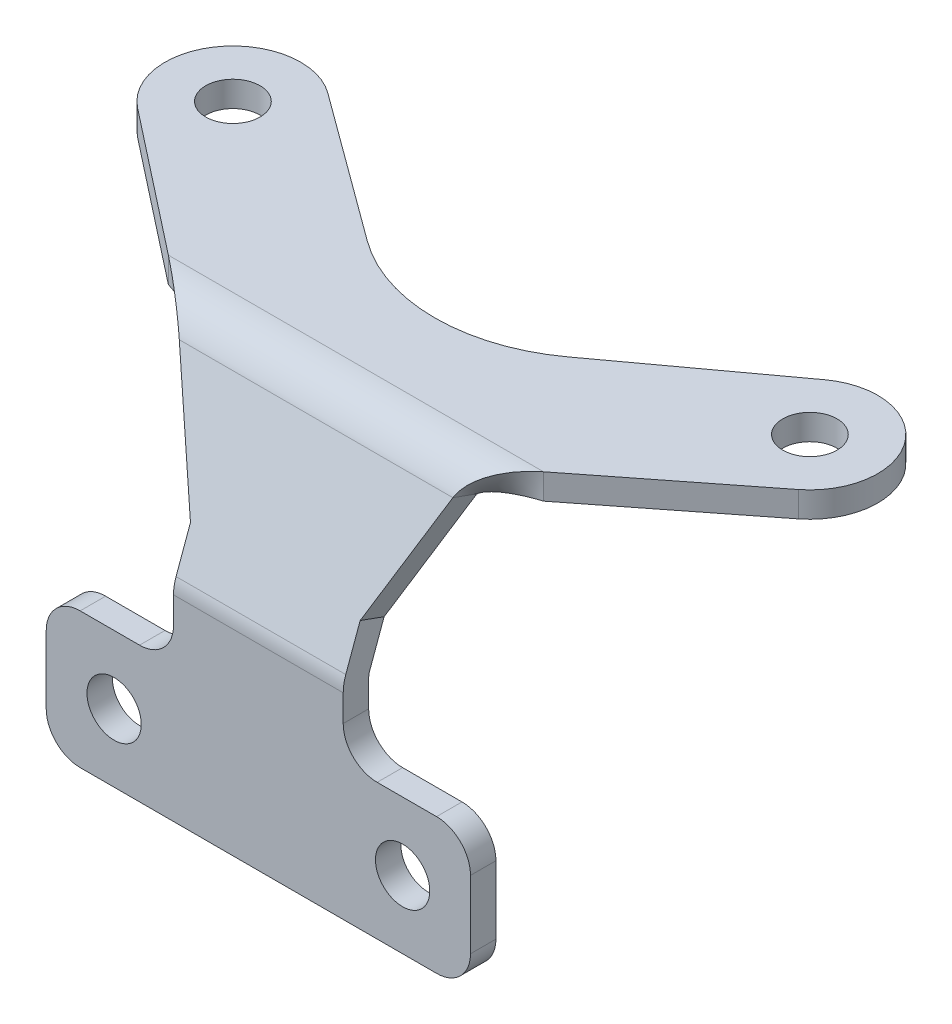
ISO-10303-21;
HEADER;
FILE_DESCRIPTION(('STEP AP214'),'2;1');
FILE_NAME('part.step','',(''),(''),'','','');
FILE_SCHEMA(('AUTOMOTIVE_DESIGN { 1 0 10303 214 1 1 1 1 }'));
ENDSEC;
DATA;
#1=APPLICATION_CONTEXT('core data for automotive mechanical design processes');
#2=APPLICATION_PROTOCOL_DEFINITION('international standard','automotive_design',2000,#1);
#3=PRODUCT_CONTEXT('',#1,'mechanical');
#4=PRODUCT('Part','Part','',(#3));
#5=PRODUCT_RELATED_PRODUCT_CATEGORY('part','',(#4));
#6=PRODUCT_DEFINITION_FORMATION('','',#4);
#7=PRODUCT_DEFINITION_CONTEXT('part definition',#1,'design');
#8=PRODUCT_DEFINITION('design','',#6,#7);
#9=PRODUCT_DEFINITION_SHAPE('','',#8);
#10=(LENGTH_UNIT() NAMED_UNIT(*) SI_UNIT(.MILLI.,.METRE.));
#11=(NAMED_UNIT(*) PLANE_ANGLE_UNIT() SI_UNIT($,.RADIAN.));
#12=(NAMED_UNIT(*) SI_UNIT($,.STERADIAN.) SOLID_ANGLE_UNIT());
#13=UNCERTAINTY_MEASURE_WITH_UNIT(LENGTH_MEASURE(1.E-05),#10,'distance_accuracy_value','');
#14=(GEOMETRIC_REPRESENTATION_CONTEXT(3) GLOBAL_UNCERTAINTY_ASSIGNED_CONTEXT((#13)) GLOBAL_UNIT_ASSIGNED_CONTEXT((#10,
#11,#12)) REPRESENTATION_CONTEXT('',''));
#15=CARTESIAN_POINT('',(0.,0.,0.));
#16=DIRECTION('',(0.,0.,1.));
#17=DIRECTION('',(1.,0.,0.));
#18=AXIS2_PLACEMENT_3D('',#15,#16,#17);
#19=CARTESIAN_POINT('',(22.5,-10.9899096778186,21.));
#20=DIRECTION('',(0.,0.,-1.));
#21=DIRECTION('',(-1.,0.,0.));
#22=AXIS2_PLACEMENT_3D('',#19,#20,#21);
#23=PLANE('',#22);
#24=CARTESIAN_POINT('',(10.5,-21.,21.));
#25=DIRECTION('',(0.,0.,-1.));
#26=DIRECTION('',(-1.,0.,0.));
#27=AXIS2_PLACEMENT_3D('',#24,#25,#26);
#28=CIRCLE('',#27,2.);
#29=CARTESIAN_POINT('',(12.5,-21.,21.));
#30=VERTEX_POINT('',#29);
#31=CARTESIAN_POINT('',(10.5,-23.,21.));
#32=VERTEX_POINT('',#31);
#33=EDGE_CURVE('E196',#30,#32,#28,.T.);
#34=ORIENTED_EDGE('',*,*,#33,.F.);
#35=DIRECTION('',(0.,-1.,0.));
#36=VECTOR('',#35,1.);
#37=CARTESIAN_POINT('',(12.5,-10.9899096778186,21.));
#38=LINE('',#37,#36);
#39=CARTESIAN_POINT('',(12.5,-17.,21.));
#40=VERTEX_POINT('',#39);
#41=EDGE_CURVE('E191',#30,#40,#38,.F.);
#42=ORIENTED_EDGE('',*,*,#41,.T.);
#43=CARTESIAN_POINT('',(10.5,-17.,21.));
#44=DIRECTION('',(0.,0.,1.));
#45=DIRECTION('',(1.,0.,0.));
#46=AXIS2_PLACEMENT_3D('',#43,#44,#45);
#47=CIRCLE('',#46,2.);
#48=CARTESIAN_POINT('',(10.5,-15.,21.));
#49=VERTEX_POINT('',#48);
#50=EDGE_CURVE('E507',#49,#40,#47,.F.);
#51=ORIENTED_EDGE('',*,*,#50,.F.);
#52=DIRECTION('',(1.,0.,0.));
#53=VECTOR('',#52,1.);
#54=CARTESIAN_POINT('',(22.5,-15.,21.));
#55=LINE('',#54,#53);
#56=CARTESIAN_POINT('',(7.00000000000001,-15.,21.));
#57=VERTEX_POINT('',#56);
#58=EDGE_CURVE('E230',#49,#57,#55,.F.);
#59=ORIENTED_EDGE('',*,*,#58,.T.);
#60=CARTESIAN_POINT('',(7.,-13.,21.));
#61=DIRECTION('',(0.,0.,-1.));
#62=DIRECTION('',(-1.,0.,0.));
#63=AXIS2_PLACEMENT_3D('',#60,#61,#62);
#64=CIRCLE('',#63,2.);
#65=CARTESIAN_POINT('',(5.,-13.,21.));
#66=VERTEX_POINT('',#65);
#67=EDGE_CURVE('E226',#57,#66,#64,.T.);
#68=ORIENTED_EDGE('',*,*,#67,.T.);
#69=DIRECTION('',(0.,-1.,0.));
#70=VECTOR('',#69,1.);
#71=CARTESIAN_POINT('',(5.,-10.9899096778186,21.));
#72=LINE('',#71,#70);
#73=CARTESIAN_POINT('',(5.,-11.4307271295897,21.));
#74=VERTEX_POINT('',#73);
#75=EDGE_CURVE('E224',#66,#74,#72,.F.);
#76=ORIENTED_EDGE('',*,*,#75,.T.);
#77=DIRECTION('',(-1.,0.,0.));
#78=VECTOR('',#77,1.);
#79=CARTESIAN_POINT('',(22.5,-11.4307271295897,21.));
#80=LINE('',#79,#78);
#81=CARTESIAN_POINT('',(-4.99999999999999,-11.4307271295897,21.));
#82=VERTEX_POINT('',#81);
#83=EDGE_CURVE('E497',#82,#74,#80,.F.);
#84=ORIENTED_EDGE('',*,*,#83,.F.);
#85=DIRECTION('',(0.,1.,0.));
#86=VECTOR('',#85,1.);
#87=CARTESIAN_POINT('',(-4.99999999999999,-10.9899096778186,21.));
#88=LINE('',#87,#86);
#89=CARTESIAN_POINT('',(-4.99999999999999,-13.,21.));
#90=VERTEX_POINT('',#89);
#91=EDGE_CURVE('E502',#82,#90,#88,.F.);
#92=ORIENTED_EDGE('',*,*,#91,.T.);
#93=CARTESIAN_POINT('',(-6.99999999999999,-13.,21.));
#94=DIRECTION('',(0.,0.,-1.));
#95=DIRECTION('',(-1.,0.,0.));
#96=AXIS2_PLACEMENT_3D('',#93,#94,#95);
#97=CIRCLE('',#96,2.);
#98=CARTESIAN_POINT('',(-6.99999999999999,-15.,21.));
#99=VERTEX_POINT('',#98);
#100=EDGE_CURVE('E238',#90,#99,#97,.T.);
#101=ORIENTED_EDGE('',*,*,#100,.T.);
#102=DIRECTION('',(1.,0.,0.));
#103=VECTOR('',#102,1.);
#104=CARTESIAN_POINT('',(22.5,-15.,21.));
#105=LINE('',#104,#103);
#106=CARTESIAN_POINT('',(-10.5,-15.,21.));
#107=VERTEX_POINT('',#106);
#108=EDGE_CURVE('E235',#99,#107,#105,.F.);
#109=ORIENTED_EDGE('',*,*,#108,.T.);
#110=CARTESIAN_POINT('',(-10.5,-17.,21.));
#111=DIRECTION('',(0.,0.,1.));
#112=DIRECTION('',(1.,0.,0.));
#113=AXIS2_PLACEMENT_3D('',#110,#111,#112);
#114=CIRCLE('',#113,2.);
#115=CARTESIAN_POINT('',(-12.5,-17.,21.));
#116=VERTEX_POINT('',#115);
#117=EDGE_CURVE('E516',#116,#107,#114,.F.);
#118=ORIENTED_EDGE('',*,*,#117,.F.);
#119=DIRECTION('',(0.,1.,0.));
#120=VECTOR('',#119,1.);
#121=CARTESIAN_POINT('',(-12.5,-10.9899096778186,21.));
#122=LINE('',#121,#120);
#123=CARTESIAN_POINT('',(-12.5,-21.,21.));
#124=VERTEX_POINT('',#123);
#125=EDGE_CURVE('E240',#116,#124,#122,.F.);
#126=ORIENTED_EDGE('',*,*,#125,.T.);
#127=CARTESIAN_POINT('',(-10.5,-21.,21.));
#128=DIRECTION('',(0.,0.,-1.));
#129=DIRECTION('',(-1.,0.,0.));
#130=AXIS2_PLACEMENT_3D('',#127,#128,#129);
#131=CIRCLE('',#130,2.);
#132=CARTESIAN_POINT('',(-10.5,-23.,21.));
#133=VERTEX_POINT('',#132);
#134=EDGE_CURVE('E210',#133,#124,#131,.T.);
#135=ORIENTED_EDGE('',*,*,#134,.F.);
#136=DIRECTION('',(1.,0.,0.));
#137=VECTOR('',#136,1.);
#138=CARTESIAN_POINT('',(22.5,-23.,21.));
#139=LINE('',#138,#137);
#140=EDGE_CURVE('E207',#32,#133,#139,.F.);
#141=ORIENTED_EDGE('',*,*,#140,.F.);
#142=EDGE_LOOP('',(#34,#42,#51,#59,#68,#76,#84,#92,#101,#109,#118,#126,#135,#141));
#143=FACE_BOUND('',#142,.T.);
#144=CARTESIAN_POINT('',(-8.49999999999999,-19.,21.));
#145=DIRECTION('',(0.,0.,1.));
#146=DIRECTION('',(1.,0.,0.));
#147=AXIS2_PLACEMENT_3D('',#144,#145,#146);
#148=CIRCLE('',#147,1.6);
#149=CARTESIAN_POINT('',(-6.89999999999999,-19.,21.));
#150=VERTEX_POINT('',#149);
#151=EDGE_CURVE('E229',#150,#150,#148,.F.);
#152=ORIENTED_EDGE('',*,*,#151,.T.);
#153=EDGE_LOOP('',(#152));
#154=FACE_BOUND('',#153,.T.);
#155=CARTESIAN_POINT('',(8.50000000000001,-19.,21.));
#156=DIRECTION('',(0.,0.,1.));
#157=DIRECTION('',(1.,0.,0.));
#158=AXIS2_PLACEMENT_3D('',#155,#156,#157);
#159=CIRCLE('',#158,1.6);
#160=CARTESIAN_POINT('',(10.1,-19.,21.));
#161=VERTEX_POINT('',#160);
#162=EDGE_CURVE('E20',#161,#161,#159,.F.);
#163=ORIENTED_EDGE('',*,*,#162,.T.);
#164=EDGE_LOOP('',(#163));
#165=FACE_BOUND('',#164,.T.);
#166=ADVANCED_FACE('F17',(#143,#154,#165),#23,.F.);
#167=CARTESIAN_POINT('',(8.50000000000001,-19.,11.));
#168=DIRECTION('',(0.,0.,1.));
#169=DIRECTION('',(1.,0.,0.));
#170=AXIS2_PLACEMENT_3D('',#167,#168,#169);
#171=CYLINDRICAL_SURFACE('',#170,1.6);
#172=CARTESIAN_POINT('',(8.50000000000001,-19.,19.5));
#173=DIRECTION('',(0.,0.,1.));
#174=DIRECTION('',(1.,0.,0.));
#175=AXIS2_PLACEMENT_3D('',#172,#173,#174);
#176=CIRCLE('',#175,1.6);
#177=CARTESIAN_POINT('',(10.1,-19.,19.5));
#178=VERTEX_POINT('',#177);
#179=EDGE_CURVE('E648',#178,#178,#176,.T.);
#180=ORIENTED_EDGE('',*,*,#179,.F.);
#181=EDGE_LOOP('',(#180));
#182=FACE_BOUND('',#181,.T.);
#183=ORIENTED_EDGE('',*,*,#162,.F.);
#184=EDGE_LOOP('',(#183));
#185=FACE_BOUND('',#184,.T.);
#186=ADVANCED_FACE('F531',(#182,#185),#171,.F.);
#187=CARTESIAN_POINT('',(-8.49999999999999,-19.,11.));
#188=DIRECTION('',(0.,0.,1.));
#189=DIRECTION('',(1.,0.,0.));
#190=AXIS2_PLACEMENT_3D('',#187,#188,#189);
#191=CYLINDRICAL_SURFACE('',#190,1.6);
#192=CARTESIAN_POINT('',(-8.49999999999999,-19.,19.5));
#193=DIRECTION('',(0.,0.,1.));
#194=DIRECTION('',(1.,0.,0.));
#195=AXIS2_PLACEMENT_3D('',#192,#193,#194);
#196=CIRCLE('',#195,1.6);
#197=CARTESIAN_POINT('',(-6.89999999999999,-19.,19.5));
#198=VERTEX_POINT('',#197);
#199=EDGE_CURVE('E489',#198,#198,#196,.T.);
#200=ORIENTED_EDGE('',*,*,#199,.F.);
#201=EDGE_LOOP('',(#200));
#202=FACE_BOUND('',#201,.T.);
#203=ORIENTED_EDGE('',*,*,#151,.F.);
#204=EDGE_LOOP('',(#203));
#205=FACE_BOUND('',#204,.T.);
#206=ADVANCED_FACE('F533',(#202,#205),#191,.F.);
#207=CARTESIAN_POINT('',(12.5,-10.9899096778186,19.5));
#208=DIRECTION('',(-1.,0.,0.));
#209=DIRECTION('',(0.,-1.,0.));
#210=AXIS2_PLACEMENT_3D('',#207,#208,#209);
#211=PLANE('',#210);
#212=DIRECTION('',(0.,0.,-1.));
#213=VECTOR('',#212,1.);
#214=CARTESIAN_POINT('',(12.5,-21.,19.5));
#215=LINE('',#214,#213);
#216=CARTESIAN_POINT('',(12.5,-21.,19.5));
#217=VERTEX_POINT('',#216);
#218=EDGE_CURVE('E203',#217,#30,#215,.F.);
#219=ORIENTED_EDGE('',*,*,#218,.F.);
#220=DIRECTION('',(0.,1.,0.));
#221=VECTOR('',#220,1.);
#222=CARTESIAN_POINT('',(12.5,-10.9899096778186,19.5));
#223=LINE('',#222,#221);
#224=CARTESIAN_POINT('',(12.5,-17.,19.5));
#225=VERTEX_POINT('',#224);
#226=EDGE_CURVE('E486',#225,#217,#223,.F.);
#227=ORIENTED_EDGE('',*,*,#226,.F.);
#228=DIRECTION('',(0.,0.,1.));
#229=VECTOR('',#228,1.);
#230=CARTESIAN_POINT('',(12.5,-17.,19.5));
#231=LINE('',#230,#229);
#232=EDGE_CURVE('E504',#40,#225,#231,.F.);
#233=ORIENTED_EDGE('',*,*,#232,.F.);
#234=ORIENTED_EDGE('',*,*,#41,.F.);
#235=EDGE_LOOP('',(#219,#227,#233,#234));
#236=FACE_BOUND('',#235,.T.);
#237=ADVANCED_FACE('F539',(#236),#211,.F.);
#238=CARTESIAN_POINT('',(10.5,-21.,19.5));
#239=DIRECTION('',(0.,0.,-1.));
#240=DIRECTION('',(-1.,0.,0.));
#241=AXIS2_PLACEMENT_3D('',#238,#239,#240);
#242=CYLINDRICAL_SURFACE('',#241,2.);
#243=ORIENTED_EDGE('',*,*,#33,.T.);
#244=DIRECTION('',(0.,0.,-1.));
#245=VECTOR('',#244,1.);
#246=CARTESIAN_POINT('',(10.5,-23.,19.5));
#247=LINE('',#246,#245);
#248=CARTESIAN_POINT('',(10.5,-23.,19.5));
#249=VERTEX_POINT('',#248);
#250=EDGE_CURVE('E201',#249,#32,#247,.F.);
#251=ORIENTED_EDGE('',*,*,#250,.F.);
#252=CARTESIAN_POINT('',(10.5,-21.,19.5));
#253=DIRECTION('',(0.,0.,-1.));
#254=DIRECTION('',(-1.,0.,0.));
#255=AXIS2_PLACEMENT_3D('',#252,#253,#254);
#256=CIRCLE('',#255,2.);
#257=EDGE_CURVE('E485',#217,#249,#256,.T.);
#258=ORIENTED_EDGE('',*,*,#257,.F.);
#259=ORIENTED_EDGE('',*,*,#218,.T.);
#260=EDGE_LOOP('',(#243,#251,#258,#259));
#261=FACE_BOUND('',#260,.T.);
#262=ADVANCED_FACE('F198',(#261),#242,.T.);
#263=CARTESIAN_POINT('',(22.5,-23.,19.5));
#264=DIRECTION('',(0.,-1.,0.));
#265=DIRECTION('',(0.,0.,-1.));
#266=AXIS2_PLACEMENT_3D('',#263,#264,#265);
#267=PLANE('',#266);
#268=ORIENTED_EDGE('',*,*,#140,.T.);
#269=DIRECTION('',(0.,0.,-1.));
#270=VECTOR('',#269,1.);
#271=CARTESIAN_POINT('',(-10.5,-23.,19.5));
#272=LINE('',#271,#270);
#273=CARTESIAN_POINT('',(-10.5,-23.,19.5));
#274=VERTEX_POINT('',#273);
#275=EDGE_CURVE('E213',#274,#133,#272,.F.);
#276=ORIENTED_EDGE('',*,*,#275,.F.);
#277=DIRECTION('',(-1.,0.,0.));
#278=VECTOR('',#277,1.);
#279=CARTESIAN_POINT('',(22.5,-23.,19.5));
#280=LINE('',#279,#278);
#281=EDGE_CURVE('E217',#249,#274,#280,.T.);
#282=ORIENTED_EDGE('',*,*,#281,.F.);
#283=ORIENTED_EDGE('',*,*,#250,.T.);
#284=EDGE_LOOP('',(#268,#276,#282,#283));
#285=FACE_BOUND('',#284,.T.);
#286=ADVANCED_FACE('F215',(#285),#267,.T.);
#287=CARTESIAN_POINT('',(-10.5,-21.,19.5));
#288=DIRECTION('',(0.,0.,-1.));
#289=DIRECTION('',(-1.,0.,0.));
#290=AXIS2_PLACEMENT_3D('',#287,#288,#289);
#291=CYLINDRICAL_SURFACE('',#290,2.);
#292=ORIENTED_EDGE('',*,*,#134,.T.);
#293=DIRECTION('',(0.,0.,1.));
#294=VECTOR('',#293,1.);
#295=CARTESIAN_POINT('',(-12.5,-21.,19.5));
#296=LINE('',#295,#294);
#297=CARTESIAN_POINT('',(-12.5,-21.,19.5));
#298=VERTEX_POINT('',#297);
#299=EDGE_CURVE('E242',#124,#298,#296,.F.);
#300=ORIENTED_EDGE('',*,*,#299,.T.);
#301=CARTESIAN_POINT('',(-10.5,-21.,19.5));
#302=DIRECTION('',(0.,0.,-1.));
#303=DIRECTION('',(-1.,0.,0.));
#304=AXIS2_PLACEMENT_3D('',#301,#302,#303);
#305=CIRCLE('',#304,2.);
#306=EDGE_CURVE('E483',#274,#298,#305,.T.);
#307=ORIENTED_EDGE('',*,*,#306,.F.);
#308=ORIENTED_EDGE('',*,*,#275,.T.);
#309=EDGE_LOOP('',(#292,#300,#307,#308));
#310=FACE_BOUND('',#309,.T.);
#311=ADVANCED_FACE('F550',(#310),#291,.T.);
#312=CARTESIAN_POINT('',(-12.5,-10.9899096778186,19.5));
#313=DIRECTION('',(1.,0.,0.));
#314=DIRECTION('',(0.,1.,0.));
#315=AXIS2_PLACEMENT_3D('',#312,#313,#314);
#316=PLANE('',#315);
#317=DIRECTION('',(0.,0.,1.));
#318=VECTOR('',#317,1.);
#319=CARTESIAN_POINT('',(-12.5,-17.,19.5));
#320=LINE('',#319,#318);
#321=CARTESIAN_POINT('',(-12.5,-17.,19.5));
#322=VERTEX_POINT('',#321);
#323=EDGE_CURVE('E241',#322,#116,#320,.T.);
#324=ORIENTED_EDGE('',*,*,#323,.F.);
#325=DIRECTION('',(0.,1.,0.));
#326=VECTOR('',#325,1.);
#327=CARTESIAN_POINT('',(-12.5,-10.9899096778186,19.5));
#328=LINE('',#327,#326);
#329=EDGE_CURVE('E480',#298,#322,#328,.T.);
#330=ORIENTED_EDGE('',*,*,#329,.F.);
#331=ORIENTED_EDGE('',*,*,#299,.F.);
#332=ORIENTED_EDGE('',*,*,#125,.F.);
#333=EDGE_LOOP('',(#324,#330,#331,#332));
#334=FACE_BOUND('',#333,.T.);
#335=ADVANCED_FACE('F553',(#334),#316,.F.);
#336=CARTESIAN_POINT('',(-10.5,-17.,19.5));
#337=DIRECTION('',(0.,0.,1.));
#338=DIRECTION('',(1.,0.,0.));
#339=AXIS2_PLACEMENT_3D('',#336,#337,#338);
#340=CYLINDRICAL_SURFACE('',#339,2.);
#341=ORIENTED_EDGE('',*,*,#117,.T.);
#342=DIRECTION('',(0.,0.,-1.));
#343=VECTOR('',#342,1.);
#344=CARTESIAN_POINT('',(-10.5,-15.,19.5));
#345=LINE('',#344,#343);
#346=CARTESIAN_POINT('',(-10.5,-15.,19.5));
#347=VERTEX_POINT('',#346);
#348=EDGE_CURVE('E239',#107,#347,#345,.T.);
#349=ORIENTED_EDGE('',*,*,#348,.T.);
#350=CARTESIAN_POINT('',(-10.5,-17.,19.5));
#351=DIRECTION('',(0.,0.,1.));
#352=DIRECTION('',(1.,0.,0.));
#353=AXIS2_PLACEMENT_3D('',#350,#351,#352);
#354=CIRCLE('',#353,2.);
#355=EDGE_CURVE('E479',#322,#347,#354,.F.);
#356=ORIENTED_EDGE('',*,*,#355,.F.);
#357=ORIENTED_EDGE('',*,*,#323,.T.);
#358=EDGE_LOOP('',(#341,#349,#356,#357));
#359=FACE_BOUND('',#358,.T.);
#360=ADVANCED_FACE('F556',(#359),#340,.T.);
#361=CARTESIAN_POINT('',(22.5,-15.,19.5));
#362=DIRECTION('',(0.,-1.,0.));
#363=DIRECTION('',(0.,0.,-1.));
#364=AXIS2_PLACEMENT_3D('',#361,#362,#363);
#365=PLANE('',#364);
#366=DIRECTION('',(0.,0.,-1.));
#367=VECTOR('',#366,1.);
#368=CARTESIAN_POINT('',(-6.99999999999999,-15.,19.5));
#369=LINE('',#368,#367);
#370=CARTESIAN_POINT('',(-6.99999999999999,-15.,19.5));
#371=VERTEX_POINT('',#370);
#372=EDGE_CURVE('E227',#99,#371,#369,.T.);
#373=ORIENTED_EDGE('',*,*,#372,.T.);
#374=DIRECTION('',(-1.,0.,0.));
#375=VECTOR('',#374,1.);
#376=CARTESIAN_POINT('',(22.5,-15.,19.5));
#377=LINE('',#376,#375);
#378=EDGE_CURVE('E476',#347,#371,#377,.F.);
#379=ORIENTED_EDGE('',*,*,#378,.F.);
#380=ORIENTED_EDGE('',*,*,#348,.F.);
#381=ORIENTED_EDGE('',*,*,#108,.F.);
#382=EDGE_LOOP('',(#373,#379,#380,#381));
#383=FACE_BOUND('',#382,.T.);
#384=ADVANCED_FACE('F560',(#383),#365,.F.);
#385=CARTESIAN_POINT('',(-6.99999999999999,-13.,19.5));
#386=DIRECTION('',(0.,0.,-1.));
#387=DIRECTION('',(-1.,0.,0.));
#388=AXIS2_PLACEMENT_3D('',#385,#386,#387);
#389=CYLINDRICAL_SURFACE('',#388,2.);
#390=ORIENTED_EDGE('',*,*,#372,.F.);
#391=ORIENTED_EDGE('',*,*,#100,.F.);
#392=DIRECTION('',(0.,0.,-1.));
#393=VECTOR('',#392,1.);
#394=CARTESIAN_POINT('',(-4.99999999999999,-13.,19.5));
#395=LINE('',#394,#393);
#396=CARTESIAN_POINT('',(-4.99999999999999,-13.,19.5));
#397=VERTEX_POINT('',#396);
#398=EDGE_CURVE('E501',#90,#397,#395,.T.);
#399=ORIENTED_EDGE('',*,*,#398,.T.);
#400=CARTESIAN_POINT('',(-6.99999999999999,-13.,19.5));
#401=DIRECTION('',(0.,0.,-1.));
#402=DIRECTION('',(-1.,0.,0.));
#403=AXIS2_PLACEMENT_3D('',#400,#401,#402);
#404=CIRCLE('',#403,2.);
#405=EDGE_CURVE('E475',#371,#397,#404,.F.);
#406=ORIENTED_EDGE('',*,*,#405,.F.);
#407=EDGE_LOOP('',(#390,#391,#399,#406));
#408=FACE_BOUND('',#407,.T.);
#409=ADVANCED_FACE('F564',(#408),#389,.F.);
#410=CARTESIAN_POINT('',(7.,-13.,19.5));
#411=DIRECTION('',(0.,0.,-1.));
#412=DIRECTION('',(-1.,0.,0.));
#413=AXIS2_PLACEMENT_3D('',#410,#411,#412);
#414=CYLINDRICAL_SURFACE('',#413,2.);
#415=DIRECTION('',(0.,0.,-1.));
#416=VECTOR('',#415,1.);
#417=CARTESIAN_POINT('',(5.,-13.,19.5));
#418=LINE('',#417,#416);
#419=CARTESIAN_POINT('',(5.00000000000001,-13.,19.5));
#420=VERTEX_POINT('',#419);
#421=EDGE_CURVE('E511',#66,#420,#418,.T.);
#422=ORIENTED_EDGE('',*,*,#421,.F.);
#423=ORIENTED_EDGE('',*,*,#67,.F.);
#424=DIRECTION('',(0.,0.,1.));
#425=VECTOR('',#424,1.);
#426=CARTESIAN_POINT('',(7.00000000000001,-15.,19.5));
#427=LINE('',#426,#425);
#428=CARTESIAN_POINT('',(7.00000000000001,-15.,19.5));
#429=VERTEX_POINT('',#428);
#430=EDGE_CURVE('E234',#57,#429,#427,.F.);
#431=ORIENTED_EDGE('',*,*,#430,.T.);
#432=CARTESIAN_POINT('',(7.,-13.,19.5));
#433=DIRECTION('',(0.,0.,-1.));
#434=DIRECTION('',(-1.,0.,0.));
#435=AXIS2_PLACEMENT_3D('',#432,#433,#434);
#436=CIRCLE('',#435,2.);
#437=EDGE_CURVE('E468',#420,#429,#436,.F.);
#438=ORIENTED_EDGE('',*,*,#437,.F.);
#439=EDGE_LOOP('',(#422,#423,#431,#438));
#440=FACE_BOUND('',#439,.T.);
#441=ADVANCED_FACE('F568',(#440),#414,.F.);
#442=CARTESIAN_POINT('',(22.5,-15.,19.5));
#443=DIRECTION('',(0.,-1.,0.));
#444=DIRECTION('',(1.,0.,0.));
#445=AXIS2_PLACEMENT_3D('',#442,#443,#444);
#446=PLANE('',#445);
#447=DIRECTION('',(0.,0.,1.));
#448=VECTOR('',#447,1.);
#449=CARTESIAN_POINT('',(10.5,-15.,19.5));
#450=LINE('',#449,#448);
#451=CARTESIAN_POINT('',(10.5,-15.,19.5));
#452=VERTEX_POINT('',#451);
#453=EDGE_CURVE('E233',#452,#49,#450,.T.);
#454=ORIENTED_EDGE('',*,*,#453,.F.);
#455=DIRECTION('',(-1.,0.,0.));
#456=VECTOR('',#455,1.);
#457=CARTESIAN_POINT('',(22.5,-15.,19.5));
#458=LINE('',#457,#456);
#459=EDGE_CURVE('E464',#429,#452,#458,.F.);
#460=ORIENTED_EDGE('',*,*,#459,.F.);
#461=ORIENTED_EDGE('',*,*,#430,.F.);
#462=ORIENTED_EDGE('',*,*,#58,.F.);
#463=EDGE_LOOP('',(#454,#460,#461,#462));
#464=FACE_BOUND('',#463,.T.);
#465=ADVANCED_FACE('F572',(#464),#446,.F.);
#466=CARTESIAN_POINT('',(10.5,-17.,19.5));
#467=DIRECTION('',(0.,0.,1.));
#468=DIRECTION('',(1.,0.,0.));
#469=AXIS2_PLACEMENT_3D('',#466,#467,#468);
#470=CYLINDRICAL_SURFACE('',#469,2.);
#471=ORIENTED_EDGE('',*,*,#50,.T.);
#472=ORIENTED_EDGE('',*,*,#232,.T.);
#473=CARTESIAN_POINT('',(10.5,-17.,19.5));
#474=DIRECTION('',(0.,0.,1.));
#475=DIRECTION('',(1.,0.,0.));
#476=AXIS2_PLACEMENT_3D('',#473,#474,#475);
#477=CIRCLE('',#476,2.);
#478=EDGE_CURVE('E467',#452,#225,#477,.F.);
#479=ORIENTED_EDGE('',*,*,#478,.F.);
#480=ORIENTED_EDGE('',*,*,#453,.T.);
#481=EDGE_LOOP('',(#471,#472,#479,#480));
#482=FACE_BOUND('',#481,.T.);
#483=ADVANCED_FACE('F576',(#482),#470,.T.);
#484=CARTESIAN_POINT('',(22.5,-11.4307271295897,18.5));
#485=DIRECTION('',(-1.,0.,0.));
#486=DIRECTION('',(0.,0.,1.));
#487=AXIS2_PLACEMENT_3D('',#484,#485,#486);
#488=CYLINDRICAL_SURFACE('',#487,2.5);
#489=CARTESIAN_POINT('',(5.,-11.4307271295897,18.5));
#490=DIRECTION('',(-1.,0.,0.));
#491=DIRECTION('',(0.,0.,1.));
#492=AXIS2_PLACEMENT_3D('',#489,#490,#491);
#493=CIRCLE('',#492,2.5);
#494=CARTESIAN_POINT('',(5.,-10.5756767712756,20.8492315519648));
#495=VERTEX_POINT('',#494);
#496=EDGE_CURVE('E500',#495,#74,#493,.F.);
#497=ORIENTED_EDGE('',*,*,#496,.F.);
#498=DIRECTION('',(1.,0.,0.));
#499=VECTOR('',#498,1.);
#500=CARTESIAN_POINT('',(22.5,-10.5756767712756,20.8492315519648));
#501=LINE('',#500,#499);
#502=CARTESIAN_POINT('',(-4.99999999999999,-10.5756767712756,20.8492315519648));
#503=VERTEX_POINT('',#502);
#504=EDGE_CURVE('E454',#495,#503,#501,.F.);
#505=ORIENTED_EDGE('',*,*,#504,.T.);
#506=CARTESIAN_POINT('',(-4.99999999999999,-11.4307271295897,18.5));
#507=DIRECTION('',(-1.,0.,0.));
#508=DIRECTION('',(0.,0.,1.));
#509=AXIS2_PLACEMENT_3D('',#506,#507,#508);
#510=CIRCLE('',#509,2.5);
#511=EDGE_CURVE('E463',#82,#503,#510,.T.);
#512=ORIENTED_EDGE('',*,*,#511,.F.);
#513=ORIENTED_EDGE('',*,*,#83,.T.);
#514=EDGE_LOOP('',(#497,#505,#512,#513));
#515=FACE_BOUND('',#514,.T.);
#516=ADVANCED_FACE('F580',(#515),#488,.T.);
#517=CARTESIAN_POINT('',(22.5,-10.9899096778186,19.5));
#518=DIRECTION('',(0.,0.,-1.));
#519=DIRECTION('',(-1.,0.,0.));
#520=AXIS2_PLACEMENT_3D('',#517,#518,#519);
#521=PLANE('',#520);
#522=ORIENTED_EDGE('',*,*,#459,.T.);
#523=ORIENTED_EDGE('',*,*,#478,.T.);
#524=ORIENTED_EDGE('',*,*,#226,.T.);
#525=ORIENTED_EDGE('',*,*,#257,.T.);
#526=ORIENTED_EDGE('',*,*,#281,.T.);
#527=ORIENTED_EDGE('',*,*,#306,.T.);
#528=ORIENTED_EDGE('',*,*,#329,.T.);
#529=ORIENTED_EDGE('',*,*,#355,.T.);
#530=ORIENTED_EDGE('',*,*,#378,.T.);
#531=ORIENTED_EDGE('',*,*,#405,.T.);
#532=DIRECTION('',(0.,1.,0.));
#533=VECTOR('',#532,1.);
#534=CARTESIAN_POINT('',(-4.99999999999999,-10.9899096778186,19.5));
#535=LINE('',#534,#533);
#536=CARTESIAN_POINT('',(-4.99999999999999,-11.4307271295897,19.5));
#537=VERTEX_POINT('',#536);
#538=EDGE_CURVE('E472',#397,#537,#535,.T.);
#539=ORIENTED_EDGE('',*,*,#538,.T.);
#540=DIRECTION('',(-1.,0.,0.));
#541=VECTOR('',#540,1.);
#542=CARTESIAN_POINT('',(22.5,-11.4307271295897,19.5));
#543=LINE('',#542,#541);
#544=CARTESIAN_POINT('',(5.00000000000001,-11.4307271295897,19.5));
#545=VERTEX_POINT('',#544);
#546=EDGE_CURVE('E459',#537,#545,#543,.F.);
#547=ORIENTED_EDGE('',*,*,#546,.T.);
#548=DIRECTION('',(0.,1.,0.));
#549=VECTOR('',#548,1.);
#550=CARTESIAN_POINT('',(5.00000000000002,-10.9899096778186,19.5));
#551=LINE('',#550,#549);
#552=EDGE_CURVE('E469',#545,#420,#551,.F.);
#553=ORIENTED_EDGE('',*,*,#552,.T.);
#554=ORIENTED_EDGE('',*,*,#437,.T.);
#555=EDGE_LOOP('',(#522,#523,#524,#525,#526,#527,#528,#529,#530,#531,#539,#547,#553,#554));
#556=FACE_BOUND('',#555,.T.);
#557=ORIENTED_EDGE('',*,*,#199,.T.);
#558=EDGE_LOOP('',(#557));
#559=FACE_BOUND('',#558,.T.);
#560=ORIENTED_EDGE('',*,*,#179,.T.);
#561=EDGE_LOOP('',(#560));
#562=FACE_BOUND('',#561,.T.);
#563=ADVANCED_FACE('F584',(#556,#559,#562),#521,.T.);
#564=CARTESIAN_POINT('',(22.5,0.,17.));
#565=DIRECTION('',(0.,-0.342020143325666,-0.93969262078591));
#566=DIRECTION('',(0.,0.93969262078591,-0.342020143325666));
#567=AXIS2_PLACEMENT_3D('',#564,#565,#566);
#568=PLANE('',#567);
#569=DIRECTION('',(-1.,0.,0.));
#570=VECTOR('',#569,1.);
#571=CARTESIAN_POINT('',(22.5,-1.64494964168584,17.5987127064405));
#572=LINE('',#571,#570);
#573=CARTESIAN_POINT('',(-8.06037478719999,-1.64494964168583,17.5987127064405));
#574=VERTEX_POINT('',#573);
#575=CARTESIAN_POINT('',(8.06037478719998,-1.64494964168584,17.5987127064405));
#576=VERTEX_POINT('',#575);
#577=EDGE_CURVE('E422',#574,#576,#572,.F.);
#578=ORIENTED_EDGE('',*,*,#577,.F.);
#579=DIRECTION('',(-0.399583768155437,0.861413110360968,-0.313528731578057));
#580=VECTOR('',#579,1.);
#581=CARTESIAN_POINT('',(-5.00000000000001,-8.24243225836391,20.));
#582=LINE('',#581,#580);
#583=CARTESIAN_POINT('',(-5.,-8.24243225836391,20.));
#584=VERTEX_POINT('',#583);
#585=EDGE_CURVE('E425',#584,#574,#582,.T.);
#586=ORIENTED_EDGE('',*,*,#585,.F.);
#587=DIRECTION('',(0.,-0.939692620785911,0.342020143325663));
#588=VECTOR('',#587,1.);
#589=CARTESIAN_POINT('',(-4.99999999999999,-8.24243225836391,20.));
#590=LINE('',#589,#588);
#591=EDGE_CURVE('E429',#584,#503,#590,.T.);
#592=ORIENTED_EDGE('',*,*,#591,.T.);
#593=ORIENTED_EDGE('',*,*,#504,.F.);
#594=DIRECTION('',(0.,0.939692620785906,-0.342020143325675));
#595=VECTOR('',#594,1.);
#596=CARTESIAN_POINT('',(5.,-10.5756767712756,20.8492315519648));
#597=LINE('',#596,#595);
#598=CARTESIAN_POINT('',(4.99999999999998,-8.24243225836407,20.));
#599=VERTEX_POINT('',#598);
#600=EDGE_CURVE('E445',#495,#599,#597,.T.);
#601=ORIENTED_EDGE('',*,*,#600,.T.);
#602=DIRECTION('',(0.399583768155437,0.861413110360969,-0.313528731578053));
#603=VECTOR('',#602,1.);
#604=CARTESIAN_POINT('',(4.99999999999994,-8.24243225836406,20.));
#605=LINE('',#604,#603);
#606=EDGE_CURVE('E446',#599,#576,#605,.T.);
#607=ORIENTED_EDGE('',*,*,#606,.T.);
#608=EDGE_LOOP('',(#578,#586,#592,#593,#601,#607));
#609=FACE_BOUND('',#608,.T.);
#610=ADVANCED_FACE('F588',(#609),#568,.F.);
#611=CARTESIAN_POINT('',(11.0071191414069,4.70757121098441,15.2865842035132));
#612=DIRECTION('',(-0.916696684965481,0.375485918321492,-0.136665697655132));
#613=DIRECTION('',(-0.379042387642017,-0.925379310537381,0.));
#614=AXIS2_PLACEMENT_3D('',#611,#612,#613);
#615=PLANE('',#614);
#616=ORIENTED_EDGE('',*,*,#606,.F.);
#617=DIRECTION('',(0.,-0.342020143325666,-0.939692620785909));
#618=VECTOR('',#617,1.);
#619=CARTESIAN_POINT('',(5.,-8.24243225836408,20.));
#620=LINE('',#619,#618);
#621=CARTESIAN_POINT('',(5.,-8.75546247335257,18.5904610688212));
#622=VERTEX_POINT('',#621);
#623=EDGE_CURVE('E442',#599,#622,#620,.T.);
#624=ORIENTED_EDGE('',*,*,#623,.T.);
#625=DIRECTION('',(-0.399583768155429,-0.861413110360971,0.313528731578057));
#626=VECTOR('',#625,1.);
#627=CARTESIAN_POINT('',(8.06037478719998,-2.15797985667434,16.1891737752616));
#628=LINE('',#627,#626);
#629=CARTESIAN_POINT('',(8.06037478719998,-2.15797985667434,16.1891737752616));
#630=VERTEX_POINT('',#629);
#631=EDGE_CURVE('E404',#630,#622,#628,.T.);
#632=ORIENTED_EDGE('',*,*,#631,.F.);
#633=DIRECTION('',(0.,-0.342020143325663,-0.93969262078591));
#634=VECTOR('',#633,1.);
#635=CARTESIAN_POINT('',(8.06037478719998,-1.90146474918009,16.8939432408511));
#636=LINE('',#635,#634);
#637=EDGE_CURVE('E414',#576,#630,#636,.T.);
#638=ORIENTED_EDGE('',*,*,#637,.F.);
#639=EDGE_LOOP('',(#616,#624,#632,#638));
#640=FACE_BOUND('',#639,.T.);
#641=ADVANCED_FACE('F592',(#640),#615,.F.);
#642=CARTESIAN_POINT('',(5.,0.,17.));
#643=DIRECTION('',(-1.,0.,0.));
#644=DIRECTION('',(0.,-1.,0.));
#645=AXIS2_PLACEMENT_3D('',#642,#643,#644);
#646=PLANE('',#645);
#647=ORIENTED_EDGE('',*,*,#600,.F.);
#648=ORIENTED_EDGE('',*,*,#496,.T.);
#649=ORIENTED_EDGE('',*,*,#75,.F.);
#650=ORIENTED_EDGE('',*,*,#421,.T.);
#651=ORIENTED_EDGE('',*,*,#552,.F.);
#652=CARTESIAN_POINT('',(5.00000000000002,-11.4307271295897,18.5));
#653=DIRECTION('',(-1.,0.,0.));
#654=DIRECTION('',(0.,0.,1.));
#655=AXIS2_PLACEMENT_3D('',#652,#653,#654);
#656=CIRCLE('',#655,1.);
#657=CARTESIAN_POINT('',(5.00000000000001,-11.0887069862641,19.4396926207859));
#658=VERTEX_POINT('',#657);
#659=EDGE_CURVE('E651',#545,#658,#656,.T.);
#660=ORIENTED_EDGE('',*,*,#659,.T.);
#661=DIRECTION('',(0.,0.93969262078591,-0.342020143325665));
#662=VECTOR('',#661,1.);
#663=CARTESIAN_POINT('',(5.,-0.5130302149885,15.5904610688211));
#664=LINE('',#663,#662);
#665=EDGE_CURVE('E407',#622,#658,#664,.F.);
#666=ORIENTED_EDGE('',*,*,#665,.F.);
#667=ORIENTED_EDGE('',*,*,#623,.F.);
#668=EDGE_LOOP('',(#647,#648,#649,#650,#651,#660,#666,#667));
#669=FACE_BOUND('',#668,.T.);
#670=ADVANCED_FACE('F596',(#669),#646,.F.);
#671=CARTESIAN_POINT('',(22.5,-11.4307271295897,18.5));
#672=DIRECTION('',(-1.,0.,0.));
#673=DIRECTION('',(0.,0.,1.));
#674=AXIS2_PLACEMENT_3D('',#671,#672,#673);
#675=CYLINDRICAL_SURFACE('',#674,1.);
#676=CARTESIAN_POINT('',(-4.99999999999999,-11.4307271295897,18.5));
#677=DIRECTION('',(-1.,0.,0.));
#678=DIRECTION('',(0.,0.,1.));
#679=AXIS2_PLACEMENT_3D('',#676,#677,#678);
#680=CIRCLE('',#679,1.);
#681=CARTESIAN_POINT('',(-5.,-11.0887069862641,19.4396926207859));
#682=VERTEX_POINT('',#681);
#683=EDGE_CURVE('E492',#682,#537,#680,.F.);
#684=ORIENTED_EDGE('',*,*,#683,.F.);
#685=DIRECTION('',(1.,0.,0.));
#686=VECTOR('',#685,1.);
#687=CARTESIAN_POINT('',(22.5,-11.0887069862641,19.4396926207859));
#688=LINE('',#687,#686);
#689=EDGE_CURVE('E433',#658,#682,#688,.F.);
#690=ORIENTED_EDGE('',*,*,#689,.F.);
#691=ORIENTED_EDGE('',*,*,#659,.F.);
#692=ORIENTED_EDGE('',*,*,#546,.F.);
#693=EDGE_LOOP('',(#684,#690,#691,#692));
#694=FACE_BOUND('',#693,.T.);
#695=ADVANCED_FACE('F600',(#694),#675,.F.);
#696=CARTESIAN_POINT('',(-4.99999999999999,-0.5130302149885,15.5904610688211));
#697=DIRECTION('',(1.,0.,0.));
#698=DIRECTION('',(0.,0.,-1.));
#699=AXIS2_PLACEMENT_3D('',#696,#697,#698);
#700=PLANE('',#699);
#701=ORIENTED_EDGE('',*,*,#591,.F.);
#702=DIRECTION('',(0.,0.342020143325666,0.939692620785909));
#703=VECTOR('',#702,1.);
#704=CARTESIAN_POINT('',(-5.00000000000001,-8.75546247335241,18.5904610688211));
#705=LINE('',#704,#703);
#706=CARTESIAN_POINT('',(-5.00000000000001,-8.75546247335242,18.5904610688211));
#707=VERTEX_POINT('',#706);
#708=EDGE_CURVE('E426',#707,#584,#705,.T.);
#709=ORIENTED_EDGE('',*,*,#708,.F.);
#710=DIRECTION('',(0.,0.93969262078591,-0.342020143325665));
#711=VECTOR('',#710,1.);
#712=CARTESIAN_POINT('',(-5.00000000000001,-0.5130302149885,15.5904610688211));
#713=LINE('',#712,#711);
#714=EDGE_CURVE('E401',#682,#707,#713,.T.);
#715=ORIENTED_EDGE('',*,*,#714,.F.);
#716=ORIENTED_EDGE('',*,*,#683,.T.);
#717=ORIENTED_EDGE('',*,*,#538,.F.);
#718=ORIENTED_EDGE('',*,*,#398,.F.);
#719=ORIENTED_EDGE('',*,*,#91,.F.);
#720=ORIENTED_EDGE('',*,*,#511,.T.);
#721=EDGE_LOOP('',(#701,#709,#715,#716,#717,#718,#719,#720));
#722=FACE_BOUND('',#721,.T.);
#723=ADVANCED_FACE('F604',(#722),#700,.F.);
#724=CARTESIAN_POINT('',(-3.82209569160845,-10.7817301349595,20.9242288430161));
#725=DIRECTION('',(-0.916696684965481,-0.375485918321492,0.136665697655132));
#726=DIRECTION('',(0.379042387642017,-0.925379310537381,0.));
#727=AXIS2_PLACEMENT_3D('',#724,#725,#726);
#728=PLANE('',#727);
#729=DIRECTION('',(0.,-0.342020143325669,-0.939692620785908));
#730=VECTOR('',#729,1.);
#731=CARTESIAN_POINT('',(-8.0603747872,-1.90146474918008,16.8939432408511));
#732=LINE('',#731,#730);
#733=CARTESIAN_POINT('',(-8.0603747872,-2.15797985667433,16.1891737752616));
#734=VERTEX_POINT('',#733);
#735=EDGE_CURVE('E411',#574,#734,#732,.T.);
#736=ORIENTED_EDGE('',*,*,#735,.T.);
#737=DIRECTION('',(-0.399583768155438,0.861413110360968,-0.313528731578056));
#738=VECTOR('',#737,1.);
#739=CARTESIAN_POINT('',(-5.00000000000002,-8.75546247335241,18.5904610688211));
#740=LINE('',#739,#738);
#741=EDGE_CURVE('E394',#707,#734,#740,.T.);
#742=ORIENTED_EDGE('',*,*,#741,.F.);
#743=ORIENTED_EDGE('',*,*,#708,.T.);
#744=ORIENTED_EDGE('',*,*,#585,.T.);
#745=EDGE_LOOP('',(#736,#742,#743,#744));
#746=FACE_BOUND('',#745,.T.);
#747=ADVANCED_FACE('F608',(#746),#728,.T.);
#748=CARTESIAN_POINT('',(22.5,-2.5,15.2494811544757));
#749=DIRECTION('',(-1.,0.,0.));
#750=DIRECTION('',(0.,0.,1.));
#751=AXIS2_PLACEMENT_3D('',#748,#749,#750);
#752=CYLINDRICAL_SURFACE('',#751,2.5);
#753=CARTESIAN_POINT('',(11.0544059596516,0.,15.2494811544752));
#754=CARTESIAN_POINT('',(10.962653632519,-1.26140131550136E-05,15.3214735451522));
#755=CARTESIAN_POINT('',(10.8708970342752,-0.00311044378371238,15.3934692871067));
#756=CARTESIAN_POINT('',(10.6874260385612,-0.0155812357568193,15.5374276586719));
#757=CARTESIAN_POINT('',(10.5957122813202,-0.024969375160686,15.6093897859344));
#758=CARTESIAN_POINT('',(10.4127372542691,-0.0501383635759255,15.7529590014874));
#759=CARTESIAN_POINT('',(10.3214765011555,-0.0659253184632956,15.8245656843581));
#760=CARTESIAN_POINT('',(10.1389400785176,-0.104257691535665,15.9677907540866));
#761=CARTESIAN_POINT('',(10.047672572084,-0.126866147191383,16.0394027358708));
#762=CARTESIAN_POINT('',(9.8664372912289,-0.179036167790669,16.181606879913));
#763=CARTESIAN_POINT('',(9.7764685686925,-0.208592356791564,16.2521997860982));
#764=CARTESIAN_POINT('',(9.59830070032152,-0.274996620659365,16.3919971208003));
#765=CARTESIAN_POINT('',(9.51010023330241,-0.31183900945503,16.461202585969));
#766=CARTESIAN_POINT('',(9.28823668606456,-0.415600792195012,16.6352852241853));
#767=CARTESIAN_POINT('',(9.15607681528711,-0.487952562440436,16.7389829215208));
#768=CARTESIAN_POINT('',(8.9641938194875,-0.612034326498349,16.8895416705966));
#769=CARTESIAN_POINT('',(8.90131205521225,-0.655970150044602,16.9388811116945));
#770=CARTESIAN_POINT('',(8.77816127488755,-0.749395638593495,17.0355099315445));
#771=CARTESIAN_POINT('',(8.71789172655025,-0.798884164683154,17.0827997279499));
#772=CARTESIAN_POINT('',(8.56473387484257,-0.935858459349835,17.2029732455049));
#773=CARTESIAN_POINT('',(8.47441290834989,-1.02808680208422,17.2738425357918));
#774=CARTESIAN_POINT('',(8.30634497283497,-1.22917303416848,17.4057150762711));
#775=CARTESIAN_POINT('',(8.22854463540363,-1.33795627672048,17.4667602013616));
#776=CARTESIAN_POINT('',(8.12407323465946,-1.51616206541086,17.548732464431));
#777=CARTESIAN_POINT('',(8.09078594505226,-1.57941235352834,17.574850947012));
#778=CARTESIAN_POINT('',(8.06037478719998,-1.64494964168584,17.5987127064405));
#779=B_SPLINE_CURVE_WITH_KNOTS('',3,(#753,#754,#755,#756,#757,#758,#759,#760,#761,#762,#763,
#764,#765,#766,#767,#768,#769,#770,#771,#772,#773,#774,#775,#776,#777,#778),.UNSPECIFIED.,.F.,
.F.,(4,2,2,2,2,2,2,2,2,2,2,2,4),(0.,0.349842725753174,0.70053260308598,1.05155790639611,
1.40593191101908,1.76003260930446,2.11385805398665,2.66109339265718,2.9345300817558,
3.20791078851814,3.64831050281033,4.08678025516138,4.31477284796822),.UNSPECIFIED.);
#780=CARTESIAN_POINT('',(11.0544059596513,0.,15.2494811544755));
#781=VERTEX_POINT('',#780);
#782=EDGE_CURVE('E418',#781,#576,#779,.T.);
#783=ORIENTED_EDGE('',*,*,#782,.F.);
#784=DIRECTION('',(1.,0.,0.));
#785=VECTOR('',#784,1.);
#786=CARTESIAN_POINT('',(22.5,0.,15.2494811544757));
#787=LINE('',#786,#785);
#788=CARTESIAN_POINT('',(-11.054405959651,0.,15.2494811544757));
#789=VERTEX_POINT('',#788);
#790=EDGE_CURVE('E390',#781,#789,#787,.F.);
#791=ORIENTED_EDGE('',*,*,#790,.T.);
#792=CARTESIAN_POINT('',(-11.0544059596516,0.,15.2494811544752));
#793=CARTESIAN_POINT('',(-10.962653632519,-1.26140131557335E-05,15.3214735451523));
#794=CARTESIAN_POINT('',(-10.8708970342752,-0.00311044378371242,15.3934692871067));
#795=CARTESIAN_POINT('',(-10.6874260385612,-0.0155812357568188,15.5374276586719));
#796=CARTESIAN_POINT('',(-10.5957122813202,-0.0249693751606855,15.6093897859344));
#797=CARTESIAN_POINT('',(-10.4127372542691,-0.0501383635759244,15.7529590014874));
#798=CARTESIAN_POINT('',(-10.3214765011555,-0.0659253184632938,15.8245656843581));
#799=CARTESIAN_POINT('',(-10.1389400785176,-0.104257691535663,15.9677907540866));
#800=CARTESIAN_POINT('',(-10.047672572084,-0.126866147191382,16.0394027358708));
#801=CARTESIAN_POINT('',(-9.86643729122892,-0.179036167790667,16.181606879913));
#802=CARTESIAN_POINT('',(-9.77646856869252,-0.20859235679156,16.2521997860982));
#803=CARTESIAN_POINT('',(-9.59830070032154,-0.274996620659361,16.3919971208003));
#804=CARTESIAN_POINT('',(-9.51010023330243,-0.311839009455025,16.461202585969));
#805=CARTESIAN_POINT('',(-9.2882366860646,-0.415600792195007,16.6352852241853));
#806=CARTESIAN_POINT('',(-9.15607681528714,-0.487952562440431,16.7389829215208));
#807=CARTESIAN_POINT('',(-8.96419381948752,-0.612034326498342,16.8895416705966));
#808=CARTESIAN_POINT('',(-8.90131205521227,-0.655970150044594,16.9388811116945));
#809=CARTESIAN_POINT('',(-8.77816127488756,-0.749395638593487,17.0355099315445));
#810=CARTESIAN_POINT('',(-8.71789172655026,-0.798884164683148,17.0827997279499));
#811=CARTESIAN_POINT('',(-8.56473387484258,-0.93585845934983,17.2029732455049));
#812=CARTESIAN_POINT('',(-8.4744129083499,-1.02808680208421,17.2738425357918));
#813=CARTESIAN_POINT('',(-8.30634497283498,-1.22917303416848,17.4057150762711));
#814=CARTESIAN_POINT('',(-8.22854463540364,-1.33795627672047,17.4667602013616));
#815=CARTESIAN_POINT('',(-8.12407323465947,-1.51616206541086,17.548732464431));
#816=CARTESIAN_POINT('',(-8.09078594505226,-1.57941235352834,17.574850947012));
#817=CARTESIAN_POINT('',(-8.06037478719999,-1.64494964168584,17.5987127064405));
#818=B_SPLINE_CURVE_WITH_KNOTS('',3,(#792,#793,#794,#795,#796,#797,#798,#799,#800,#801,#802,
#803,#804,#805,#806,#807,#808,#809,#810,#811,#812,#813,#814,#815,#816,#817),.UNSPECIFIED.,.F.,
.F.,(4,2,2,2,2,2,2,2,2,2,2,2,4),(0.,0.349842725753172,0.700532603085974,1.0515579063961,
1.40593191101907,1.76003260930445,2.11385805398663,2.66109339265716,2.93453008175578,
3.20791078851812,3.64831050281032,4.08678025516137,4.31477284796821),.UNSPECIFIED.);
#819=EDGE_CURVE('E408',#789,#574,#818,.T.);
#820=ORIENTED_EDGE('',*,*,#819,.T.);
#821=ORIENTED_EDGE('',*,*,#577,.T.);
#822=EDGE_LOOP('',(#783,#791,#820,#821));
#823=FACE_BOUND('',#822,.T.);
#824=ADVANCED_FACE('F612',(#823),#752,.T.);
#825=CARTESIAN_POINT('',(7.86822453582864,-2.5,16.2494811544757));
#826=CARTESIAN_POINT('',(7.86822453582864,-2.5,16.7494811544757));
#827=CARTESIAN_POINT('',(7.86822453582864,-2.5,17.2494811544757));
#828=CARTESIAN_POINT('',(7.86822453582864,-2.5,17.7494811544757));
#829=CARTESIAN_POINT('',(7.86822453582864,-0.500000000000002,16.2494811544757));
#830=CARTESIAN_POINT('',(7.86822453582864,0.499999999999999,16.7494811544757));
#831=CARTESIAN_POINT('',(7.86822453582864,1.5,17.2494811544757));
#832=CARTESIAN_POINT('',(7.86822453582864,2.5,17.7494811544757));
#833=CARTESIAN_POINT('',(14.2405873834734,-0.500000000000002,14.2494811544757));
#834=CARTESIAN_POINT('',(14.2405873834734,0.499999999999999,13.7494811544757));
#835=CARTESIAN_POINT('',(14.2405873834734,1.5,13.2494811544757));
#836=CARTESIAN_POINT('',(14.2405873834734,2.5,12.7494811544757));
#837=CARTESIAN_POINT('',(14.2405873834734,-2.5,14.2494811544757));
#838=CARTESIAN_POINT('',(14.2405873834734,-2.5,13.7494811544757));
#839=CARTESIAN_POINT('',(14.2405873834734,-2.5,13.2494811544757));
#840=CARTESIAN_POINT('',(14.2405873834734,-2.5,12.7494811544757));
#841=CARTESIAN_POINT('',(14.2405873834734,-4.5,14.2494811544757));
#842=CARTESIAN_POINT('',(14.2405873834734,-5.50000000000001,13.7494811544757));
#843=CARTESIAN_POINT('',(14.2405873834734,-6.50000000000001,13.2494811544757));
#844=CARTESIAN_POINT('',(14.2405873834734,-7.5,12.7494811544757));
#845=CARTESIAN_POINT('',(7.86822453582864,-4.5,16.2494811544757));
#846=CARTESIAN_POINT('',(7.86822453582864,-5.50000000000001,16.7494811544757));
#847=CARTESIAN_POINT('',(7.86822453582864,-6.50000000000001,17.2494811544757));
#848=CARTESIAN_POINT('',(7.86822453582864,-7.50000000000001,17.7494811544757));
#849=CARTESIAN_POINT('',(7.86822453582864,-2.5,16.2494811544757));
#850=CARTESIAN_POINT('',(7.86822453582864,-2.5,16.7494811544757));
#851=CARTESIAN_POINT('',(7.86822453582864,-2.5,17.2494811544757));
#852=CARTESIAN_POINT('',(7.86822453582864,-2.5,17.7494811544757));
#853=(BOUNDED_SURFACE() B_SPLINE_SURFACE(3,3,((#825,#826,#827,#828),(#829,#830,#831,#832),(#833,
#834,#835,#836),(#837,#838,#839,#840),(#841,#842,#843,#844),(#845,#846,#847,#848),(#849,#850,
#851,#852)),.UNSPECIFIED.,.T.,.F.,.F.) B_SPLINE_SURFACE_WITH_KNOTS((4,3,4),(4,4),(0.,0.5,1.),
(0.,1.),.UNSPECIFIED.) GEOMETRIC_REPRESENTATION_ITEM() RATIONAL_B_SPLINE_SURFACE(((1.,1.,1.,1.),
(0.333333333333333,0.333333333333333,0.333333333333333,0.333333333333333),(0.333333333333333,
0.333333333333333,0.333333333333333,0.333333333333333),(1.,1.,1.,1.),(0.333333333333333,
0.333333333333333,0.333333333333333,0.333333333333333),(0.333333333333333,0.333333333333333,
0.333333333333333,0.333333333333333),(1.,1.,1.,1.))) REPRESENTATION_ITEM('') SURFACE());
#854=CARTESIAN_POINT('',(8.06037478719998,-2.15797985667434,16.1891737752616));
#855=CARTESIAN_POINT('',(8.08023366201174,-2.14088550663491,16.1829409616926));
#856=CARTESIAN_POINT('',(8.10072323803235,-2.12463901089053,16.1765101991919));
#857=CARTESIAN_POINT('',(8.14261469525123,-2.09366444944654,16.1633623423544));
#858=CARTESIAN_POINT('',(8.16401298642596,-2.07893107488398,16.1566463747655));
#859=CARTESIAN_POINT('',(8.20750386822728,-2.05069578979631,16.1429965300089));
#860=CARTESIAN_POINT('',(8.22959589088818,-2.03719290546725,16.1360628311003));
#861=CARTESIAN_POINT('',(8.27413491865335,-2.01135044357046,16.1220840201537));
#862=CARTESIAN_POINT('',(8.29657708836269,-1.99900167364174,16.1150404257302));
#863=CARTESIAN_POINT('',(8.341906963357,-1.97518961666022,16.1008134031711));
#864=CARTESIAN_POINT('',(8.36479503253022,-1.96372709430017,16.0936298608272));
#865=CARTESIAN_POINT('',(8.41092522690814,-1.94159063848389,16.0791516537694));
#866=CARTESIAN_POINT('',(8.43416749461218,-1.93091703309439,16.0718569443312));
#867=CARTESIAN_POINT('',(8.53203520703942,-1.88769806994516,16.0411406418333));
#868=CARTESIAN_POINT('',(8.60794515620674,-1.85833293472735,16.0173159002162));
#869=CARTESIAN_POINT('',(8.76142598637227,-1.80474988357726,15.9691451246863));
#870=CARTESIAN_POINT('',(8.83899846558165,-1.78053718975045,15.9447985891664));
#871=CARTESIAN_POINT('',(8.99523894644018,-1.73618437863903,15.8957616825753));
#872=CARTESIAN_POINT('',(9.07390758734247,-1.71604675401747,15.8710711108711));
#873=CARTESIAN_POINT('',(9.23315773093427,-1.67887451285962,15.8210896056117));
#874=CARTESIAN_POINT('',(9.31375011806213,-1.66189183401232,15.7957952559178));
#875=CARTESIAN_POINT('',(9.4753857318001,-1.6309325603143,15.7450650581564));
#876=CARTESIAN_POINT('',(9.55642853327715,-1.61695350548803,15.7196293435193));
#877=CARTESIAN_POINT('',(9.7188709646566,-1.59164412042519,15.6686459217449));
#878=CARTESIAN_POINT('',(9.80027052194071,-1.58031327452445,15.6430982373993));
#879=CARTESIAN_POINT('',(9.94744760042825,-1.56203067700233,15.5969059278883));
#880=CARTESIAN_POINT('',(10.0131778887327,-1.55465585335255,15.5762761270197));
#881=CARTESIAN_POINT('',(10.1447807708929,-1.54137296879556,15.5349718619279));
#882=CARTESIAN_POINT('',(10.2106533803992,-1.53546507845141,15.5142973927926));
#883=CARTESIAN_POINT('',(10.3425044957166,-1.52504745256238,15.472915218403));
#884=CARTESIAN_POINT('',(10.408483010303,-1.52053783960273,15.4522075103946));
#885=CARTESIAN_POINT('',(10.5388755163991,-1.51296289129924,15.4112831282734));
#886=CARTESIAN_POINT('',(10.6032877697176,-1.50986454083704,15.3910669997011));
#887=CARTESIAN_POINT('',(10.7321487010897,-1.50491932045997,15.3506233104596));
#888=CARTESIAN_POINT('',(10.7965973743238,-1.50307231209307,15.330395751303));
#889=CARTESIAN_POINT('',(10.9254994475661,-1.5006139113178,15.2899391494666));
#890=CARTESIAN_POINT('',(10.9899528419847,-1.50000219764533,15.2697101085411));
#891=CARTESIAN_POINT('',(11.054405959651,-1.5,15.2494811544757));
#892=B_SPLINE_CURVE_WITH_KNOTS('',3,(#854,#855,#856,#857,#858,#859,#860,#861,#862,#863,#864,
#865,#866,#867,#868,#869,#870,#871,#872,#873,#874,#875,#876,#877,#878,#879,#880,#881,#882,#883,
#884,#885,#886,#887,#888,#889,#890,#891),.UNSPECIFIED.,.F.,.F.,(4,2,2,2,2,2,2,2,2,2,2,2,2,2,2,2,
2,2,4),(0.,0.080741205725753,0.161188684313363,0.241571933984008,0.321247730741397,
0.400991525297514,0.480768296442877,0.734895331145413,0.989278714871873,1.24381723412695,
1.50223291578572,1.76043614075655,2.01858904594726,2.22642917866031,2.43429346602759,
2.64217597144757,2.84490799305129,3.04761758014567,3.25027444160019),.UNSPECIFIED.);
#893=CARTESIAN_POINT('',(11.054405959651,-1.5,15.2494811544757));
#894=VERTEX_POINT('',#893);
#895=EDGE_CURVE('E285',#630,#894,#892,.T.);
#896=DIRECTION('',(0.,1.,0.));
#897=VECTOR('',#896,1.);
#898=CARTESIAN_POINT('',(11.054405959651,-0.750000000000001,15.2494811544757));
#899=LINE('',#898,#897);
#900=EDGE_CURVE('E419',#894,#781,#899,.T.);
#901=ORIENTED_EDGE('',*,*,#637,.T.);
#902=ORIENTED_EDGE('',*,*,#895,.T.);
#903=ORIENTED_EDGE('',*,*,#900,.T.);
#904=ORIENTED_EDGE('',*,*,#782,.T.);
#905=EDGE_LOOP('',(#901,#902,#903,#904));
#906=FACE_BOUND('',#905,.T.);
#907=ADVANCED_FACE('F323',(#906),#853,.T.);
#908=CARTESIAN_POINT('',(-14.2405873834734,-2.5,14.2494811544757));
#909=CARTESIAN_POINT('',(-14.2405873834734,-2.5,13.7494811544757));
#910=CARTESIAN_POINT('',(-14.2405873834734,-2.5,13.2494811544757));
#911=CARTESIAN_POINT('',(-14.2405873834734,-2.5,12.7494811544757));
#912=CARTESIAN_POINT('',(-14.2405873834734,-4.5,14.2494811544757));
#913=CARTESIAN_POINT('',(-14.2405873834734,-5.5,13.7494811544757));
#914=CARTESIAN_POINT('',(-14.2405873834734,-6.5,13.2494811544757));
#915=CARTESIAN_POINT('',(-14.2405873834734,-7.5,12.7494811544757));
#916=CARTESIAN_POINT('',(-7.86822453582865,-4.5,16.2494811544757));
#917=CARTESIAN_POINT('',(-7.86822453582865,-5.5,16.7494811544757));
#918=CARTESIAN_POINT('',(-7.86822453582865,-6.5,17.2494811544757));
#919=CARTESIAN_POINT('',(-7.86822453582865,-7.5,17.7494811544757));
#920=CARTESIAN_POINT('',(-7.86822453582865,-2.5,16.2494811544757));
#921=CARTESIAN_POINT('',(-7.86822453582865,-2.5,16.7494811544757));
#922=CARTESIAN_POINT('',(-7.86822453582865,-2.5,17.2494811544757));
#923=CARTESIAN_POINT('',(-7.86822453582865,-2.5,17.7494811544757));
#924=CARTESIAN_POINT('',(-7.86822453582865,-0.500000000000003,16.2494811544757));
#925=CARTESIAN_POINT('',(-7.86822453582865,0.499999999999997,16.7494811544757));
#926=CARTESIAN_POINT('',(-7.86822453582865,1.5,17.2494811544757));
#927=CARTESIAN_POINT('',(-7.86822453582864,2.5,17.7494811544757));
#928=CARTESIAN_POINT('',(-14.2405873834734,-0.500000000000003,14.2494811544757));
#929=CARTESIAN_POINT('',(-14.2405873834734,0.499999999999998,13.7494811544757));
#930=CARTESIAN_POINT('',(-14.2405873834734,1.5,13.2494811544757));
#931=CARTESIAN_POINT('',(-14.2405873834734,2.5,12.7494811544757));
#932=CARTESIAN_POINT('',(-14.2405873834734,-2.5,14.2494811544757));
#933=CARTESIAN_POINT('',(-14.2405873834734,-2.5,13.7494811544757));
#934=CARTESIAN_POINT('',(-14.2405873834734,-2.5,13.2494811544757));
#935=CARTESIAN_POINT('',(-14.2405873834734,-2.5,12.7494811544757));
#936=(BOUNDED_SURFACE() B_SPLINE_SURFACE(3,3,((#908,#909,#910,#911),(#912,#913,#914,#915),(#916,
#917,#918,#919),(#920,#921,#922,#923),(#924,#925,#926,#927),(#928,#929,#930,#931),(#932,#933,
#934,#935)),.UNSPECIFIED.,.T.,.F.,.F.) B_SPLINE_SURFACE_WITH_KNOTS((4,3,4),(4,4),(0.,0.5,1.),
(0.,1.),.UNSPECIFIED.) GEOMETRIC_REPRESENTATION_ITEM() RATIONAL_B_SPLINE_SURFACE(((1.,1.,1.,1.),
(0.333333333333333,0.333333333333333,0.333333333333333,0.333333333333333),(0.333333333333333,
0.333333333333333,0.333333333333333,0.333333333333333),(1.,1.,1.,1.),(0.333333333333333,
0.333333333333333,0.333333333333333,0.333333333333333),(0.333333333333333,0.333333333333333,
0.333333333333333,0.333333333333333),(1.,1.,1.,1.))) REPRESENTATION_ITEM('') SURFACE());
#937=DIRECTION('',(0.,1.,0.));
#938=VECTOR('',#937,1.);
#939=CARTESIAN_POINT('',(-11.054405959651,-0.750000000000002,15.2494811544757));
#940=LINE('',#939,#938);
#941=CARTESIAN_POINT('',(-11.054405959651,-1.5,15.2494811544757));
#942=VERTEX_POINT('',#941);
#943=EDGE_CURVE('E413',#942,#789,#940,.T.);
#944=CARTESIAN_POINT('',(-11.054405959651,-1.5,15.2494811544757));
#945=CARTESIAN_POINT('',(-10.9764774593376,-1.50000474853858,15.2739394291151));
#946=CARTESIAN_POINT('',(-10.8985482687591,-1.50089753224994,15.2983979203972));
#947=CARTESIAN_POINT('',(-10.7425843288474,-1.50449609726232,15.3473480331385));
#948=CARTESIAN_POINT('',(-10.6645496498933,-1.50720521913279,15.3718396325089));
#949=CARTESIAN_POINT('',(-10.5084704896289,-1.51447771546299,15.4208259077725));
#950=CARTESIAN_POINT('',(-10.4304260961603,-1.51904317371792,15.4453205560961));
#951=CARTESIAN_POINT('',(-10.2744250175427,-1.53010165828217,15.4942823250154));
#952=CARTESIAN_POINT('',(-10.196468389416,-1.53659557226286,15.5187494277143));
#953=CARTESIAN_POINT('',(-10.0368661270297,-1.55198661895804,15.5688414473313));
#954=CARTESIAN_POINT('',(-9.95522949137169,-1.56098705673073,15.5944635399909));
#955=CARTESIAN_POINT('',(-9.79226229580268,-1.58139304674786,15.6456116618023));
#956=CARTESIAN_POINT('',(-9.71093162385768,-1.59279760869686,15.6711377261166));
#957=CARTESIAN_POINT('',(-9.54869427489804,-1.61825052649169,15.7220567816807));
#958=CARTESIAN_POINT('',(-9.46778737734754,-1.63229732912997,15.7474498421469));
#959=CARTESIAN_POINT('',(-9.30652364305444,-1.6633754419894,15.7980633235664));
#960=CARTESIAN_POINT('',(-9.22616659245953,-1.68040551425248,15.8232838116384));
#961=CARTESIAN_POINT('',(-9.09962989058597,-1.71010835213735,15.8629980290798));
#962=CARTESIAN_POINT('',(-9.05320279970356,-1.72162738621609,15.8775694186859));
#963=CARTESIAN_POINT('',(-8.96065869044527,-1.74598740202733,15.9066148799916));
#964=CARTESIAN_POINT('',(-8.91454170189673,-1.75882850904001,15.9210889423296));
#965=CARTESIAN_POINT('',(-8.82268877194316,-1.7860099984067,15.9499174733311));
#966=CARTESIAN_POINT('',(-8.77695299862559,-1.80035100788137,15.9642718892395));
#967=CARTESIAN_POINT('',(-8.68659447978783,-1.83055871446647,15.9926313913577));
#968=CARTESIAN_POINT('',(-8.64196499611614,-1.84640310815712,16.0066385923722));
#969=CARTESIAN_POINT('',(-8.55339825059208,-1.88006223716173,16.0344357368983));
#970=CARTESIAN_POINT('',(-8.50946078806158,-1.89787638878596,16.0482257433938));
#971=CARTESIAN_POINT('',(-8.42254274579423,-1.93587915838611,16.0755054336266));
#972=CARTESIAN_POINT('',(-8.37956166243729,-1.95606648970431,16.0889952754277));
#973=CARTESIAN_POINT('',(-8.31290828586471,-1.99022809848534,16.1099147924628));
#974=CARTESIAN_POINT('',(-8.28877300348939,-2.00320944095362,16.1174897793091));
#975=CARTESIAN_POINT('',(-8.24110755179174,-2.03031320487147,16.1324498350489));
#976=CARTESIAN_POINT('',(-8.21757704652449,-2.04443497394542,16.1398350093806));
#977=CARTESIAN_POINT('',(-8.17111556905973,-2.07412628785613,16.1544171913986));
#978=CARTESIAN_POINT('',(-8.14819021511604,-2.0897056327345,16.1616124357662));
#979=CARTESIAN_POINT('',(-8.10339703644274,-2.12252830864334,16.1756710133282));
#980=CARTESIAN_POINT('',(-8.0815311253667,-2.13977449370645,16.1825337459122));
#981=CARTESIAN_POINT('',(-8.0603747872,-2.15797985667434,16.1891737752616));
#982=B_SPLINE_CURVE_WITH_KNOTS('',3,(#944,#945,#946,#947,#948,#949,#950,#951,#952,#953,#954,
#955,#956,#957,#958,#959,#960,#961,#962,#963,#964,#965,#966,#967,#968,#969,#970,#971,#972,#973,
#974,#975,#976,#977,#978,#979,#980,#981),.UNSPECIFIED.,.F.,.F.,(4,2,2,2,2,2,2,2,2,2,2,2,2,2,2,2,
2,2,4),(0.,0.2450259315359,0.490503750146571,0.736257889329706,0.982125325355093,
1.24019917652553,1.49816693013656,1.75598351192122,2.01369336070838,2.16369292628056,
2.31370671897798,2.46378348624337,2.61190563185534,2.75998400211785,2.907982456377,
2.99325573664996,3.07848057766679,3.16432645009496,3.25032200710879),.UNSPECIFIED.);
#983=EDGE_CURVE('E276',#942,#734,#982,.T.);
#984=ORIENTED_EDGE('',*,*,#943,.F.);
#985=ORIENTED_EDGE('',*,*,#983,.T.);
#986=ORIENTED_EDGE('',*,*,#735,.F.);
#987=ORIENTED_EDGE('',*,*,#819,.F.);
#988=EDGE_LOOP('',(#984,#985,#986,#987));
#989=FACE_BOUND('',#988,.T.);
#990=ADVANCED_FACE('F291',(#989),#936,.F.);
#991=CARTESIAN_POINT('',(22.5,-0.5130302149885,15.5904610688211));
#992=DIRECTION('',(0.,-0.342020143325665,-0.93969262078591));
#993=DIRECTION('',(0.,0.93969262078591,-0.342020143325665));
#994=AXIS2_PLACEMENT_3D('',#991,#992,#993);
#995=PLANE('',#994);
#996=ORIENTED_EDGE('',*,*,#714,.T.);
#997=ORIENTED_EDGE('',*,*,#741,.T.);
#998=DIRECTION('',(-1.,0.,0.));
#999=VECTOR('',#998,1.);
#1000=CARTESIAN_POINT('',(22.5,-2.15797985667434,16.1891737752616));
#1001=LINE('',#1000,#999);
#1002=EDGE_CURVE('E284',#734,#630,#1001,.F.);
#1003=ORIENTED_EDGE('',*,*,#1002,.T.);
#1004=ORIENTED_EDGE('',*,*,#631,.T.);
#1005=ORIENTED_EDGE('',*,*,#665,.T.);
#1006=ORIENTED_EDGE('',*,*,#689,.T.);
#1007=EDGE_LOOP('',(#996,#997,#1003,#1004,#1005,#1006));
#1008=FACE_BOUND('',#1007,.T.);
#1009=ADVANCED_FACE('F315',(#1008),#995,.T.);
#1010=CARTESIAN_POINT('',(22.5,0.,0.));
#1011=DIRECTION('',(0.,-1.,0.));
#1012=DIRECTION('',(0.,0.,-1.));
#1013=AXIS2_PLACEMENT_3D('',#1010,#1011,#1012);
#1014=PLANE('',#1013);
#1015=ORIENTED_EDGE('',*,*,#790,.F.);
#1016=DIRECTION('',(0.78672939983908,0.,-0.617298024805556));
#1017=VECTOR('',#1016,1.);
#1018=CARTESIAN_POINT('',(11.6182143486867,0.,14.8070954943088));
#1019=LINE('',#1018,#1017);
#1020=CARTESIAN_POINT('',(19.4691920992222,0.,8.64691759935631));
#1021=VERTEX_POINT('',#1020);
#1022=EDGE_CURVE('E262',#1021,#781,#1019,.F.);
#1023=ORIENTED_EDGE('',*,*,#1022,.F.);
#1024=CARTESIAN_POINT('',(17.,0.,5.49999999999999));
#1025=DIRECTION('',(0.,1.,0.));
#1026=DIRECTION('',(0.,0.,1.));
#1027=AXIS2_PLACEMENT_3D('',#1024,#1025,#1026);
#1028=CIRCLE('',#1027,4.);
#1029=CARTESIAN_POINT('',(14.6354600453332,0.,2.27370943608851));
#1030=VERTEX_POINT('',#1029);
#1031=EDGE_CURVE('E263',#1030,#1021,#1028,.F.);
#1032=ORIENTED_EDGE('',*,*,#1031,.F.);
#1033=DIRECTION('',(0.806572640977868,0.,-0.591134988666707));
#1034=VECTOR('',#1033,1.);
#1035=CARTESIAN_POINT('',(6.19831301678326,0.,8.45727252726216));
#1036=LINE('',#1035,#1034);
#1037=CARTESIAN_POINT('',(5.91134988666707,0.,8.6675870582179));
#1038=VERTEX_POINT('',#1037);
#1039=EDGE_CURVE('E269',#1030,#1038,#1036,.F.);
#1040=ORIENTED_EDGE('',*,*,#1039,.T.);
#1041=CARTESIAN_POINT('',(0.,0.,0.601860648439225));
#1042=DIRECTION('',(0.,-1.,0.));
#1043=DIRECTION('',(0.,0.,-1.));
#1044=AXIS2_PLACEMENT_3D('',#1041,#1042,#1043);
#1045=CIRCLE('',#1044,10.);
#1046=CARTESIAN_POINT('',(-5.91134988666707,0.,8.66758705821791));
#1047=VERTEX_POINT('',#1046);
#1048=EDGE_CURVE('E266',#1038,#1047,#1045,.T.);
#1049=ORIENTED_EDGE('',*,*,#1048,.T.);
#1050=DIRECTION('',(-0.806572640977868,0.,-0.591134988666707));
#1051=VECTOR('',#1050,1.);
#1052=CARTESIAN_POINT('',(-6.19831301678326,0.,8.45727252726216));
#1053=LINE('',#1052,#1051);
#1054=CARTESIAN_POINT('',(-14.6354600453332,0.,2.27370943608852));
#1055=VERTEX_POINT('',#1054);
#1056=EDGE_CURVE('E274',#1055,#1047,#1053,.F.);
#1057=ORIENTED_EDGE('',*,*,#1056,.F.);
#1058=CARTESIAN_POINT('',(-17.,0.,5.49999999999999));
#1059=DIRECTION('',(0.,1.,0.));
#1060=DIRECTION('',(0.,0.,1.));
#1061=AXIS2_PLACEMENT_3D('',#1058,#1059,#1060);
#1062=CIRCLE('',#1061,4.);
#1063=CARTESIAN_POINT('',(-19.4691920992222,0.,8.64691759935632));
#1064=VERTEX_POINT('',#1063);
#1065=EDGE_CURVE('E271',#1064,#1055,#1062,.F.);
#1066=ORIENTED_EDGE('',*,*,#1065,.F.);
#1067=DIRECTION('',(-0.78672939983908,0.,-0.617298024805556));
#1068=VECTOR('',#1067,1.);
#1069=CARTESIAN_POINT('',(-11.6182143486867,0.,14.8070954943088));
#1070=LINE('',#1069,#1068);
#1071=EDGE_CURVE('E385',#1064,#789,#1070,.F.);
#1072=ORIENTED_EDGE('',*,*,#1071,.T.);
#1073=EDGE_LOOP('',(#1015,#1023,#1032,#1040,#1049,#1057,#1066,#1072));
#1074=FACE_BOUND('',#1073,.T.);
#1075=CARTESIAN_POINT('',(-17.,0.,5.49999999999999));
#1076=DIRECTION('',(0.,1.,0.));
#1077=DIRECTION('',(0.,0.,1.));
#1078=AXIS2_PLACEMENT_3D('',#1075,#1076,#1077);
#1079=CIRCLE('',#1078,1.6);
#1080=CARTESIAN_POINT('',(-17.,0.,7.1));
#1081=VERTEX_POINT('',#1080);
#1082=EDGE_CURVE('E703',#1081,#1081,#1079,.F.);
#1083=ORIENTED_EDGE('',*,*,#1082,.T.);
#1084=EDGE_LOOP('',(#1083));
#1085=FACE_BOUND('',#1084,.T.);
#1086=CARTESIAN_POINT('',(17.,0.,5.49999999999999));
#1087=DIRECTION('',(0.,1.,0.));
#1088=DIRECTION('',(0.,0.,1.));
#1089=AXIS2_PLACEMENT_3D('',#1086,#1087,#1088);
#1090=CIRCLE('',#1089,1.6);
#1091=CARTESIAN_POINT('',(17.,0.,7.09999999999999));
#1092=VERTEX_POINT('',#1091);
#1093=EDGE_CURVE('E393',#1092,#1092,#1090,.F.);
#1094=ORIENTED_EDGE('',*,*,#1093,.T.);
#1095=EDGE_LOOP('',(#1094));
#1096=FACE_BOUND('',#1095,.T.);
#1097=ADVANCED_FACE('F312',(#1074,#1085,#1096),#1014,.F.);
#1098=CARTESIAN_POINT('',(17.,-10.,5.49999999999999));
#1099=DIRECTION('',(0.,1.,0.));
#1100=DIRECTION('',(0.,0.,1.));
#1101=AXIS2_PLACEMENT_3D('',#1098,#1099,#1100);
#1102=CYLINDRICAL_SURFACE('',#1101,1.6);
#1103=CARTESIAN_POINT('',(17.,-1.5,5.49999999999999));
#1104=DIRECTION('',(0.,1.,0.));
#1105=DIRECTION('',(0.,0.,1.));
#1106=AXIS2_PLACEMENT_3D('',#1103,#1104,#1105);
#1107=CIRCLE('',#1106,1.6);
#1108=CARTESIAN_POINT('',(17.,-1.5,7.09999999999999));
#1109=VERTEX_POINT('',#1108);
#1110=EDGE_CURVE('E259',#1109,#1109,#1107,.T.);
#1111=ORIENTED_EDGE('',*,*,#1110,.F.);
#1112=EDGE_LOOP('',(#1111));
#1113=FACE_BOUND('',#1112,.T.);
#1114=ORIENTED_EDGE('',*,*,#1093,.F.);
#1115=EDGE_LOOP('',(#1114));
#1116=FACE_BOUND('',#1115,.T.);
#1117=ADVANCED_FACE('F308',(#1113,#1116),#1102,.F.);
#1118=CARTESIAN_POINT('',(-17.,-10.,5.49999999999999));
#1119=DIRECTION('',(0.,1.,0.));
#1120=DIRECTION('',(0.,0.,1.));
#1121=AXIS2_PLACEMENT_3D('',#1118,#1119,#1120);
#1122=CYLINDRICAL_SURFACE('',#1121,1.6);
#1123=CARTESIAN_POINT('',(-17.,-1.5,5.49999999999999));
#1124=DIRECTION('',(0.,1.,0.));
#1125=DIRECTION('',(0.,0.,1.));
#1126=AXIS2_PLACEMENT_3D('',#1123,#1124,#1125);
#1127=CIRCLE('',#1126,1.6);
#1128=CARTESIAN_POINT('',(-17.,-1.5,7.1));
#1129=VERTEX_POINT('',#1128);
#1130=EDGE_CURVE('E255',#1129,#1129,#1127,.T.);
#1131=ORIENTED_EDGE('',*,*,#1130,.F.);
#1132=EDGE_LOOP('',(#1131));
#1133=FACE_BOUND('',#1132,.T.);
#1134=ORIENTED_EDGE('',*,*,#1082,.F.);
#1135=EDGE_LOOP('',(#1134));
#1136=FACE_BOUND('',#1135,.T.);
#1137=ADVANCED_FACE('F302',(#1133,#1136),#1122,.F.);
#1138=CARTESIAN_POINT('',(22.5,-2.5,15.2494811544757));
#1139=DIRECTION('',(-1.,0.,0.));
#1140=DIRECTION('',(0.,0.,1.));
#1141=AXIS2_PLACEMENT_3D('',#1138,#1139,#1140);
#1142=CYLINDRICAL_SURFACE('',#1141,1.);
#1143=ORIENTED_EDGE('',*,*,#983,.F.);
#1144=DIRECTION('',(1.,0.,0.));
#1145=VECTOR('',#1144,1.);
#1146=CARTESIAN_POINT('',(22.5,-1.5,15.2494811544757));
#1147=LINE('',#1146,#1145);
#1148=EDGE_CURVE('E258',#894,#942,#1147,.F.);
#1149=ORIENTED_EDGE('',*,*,#1148,.F.);
#1150=ORIENTED_EDGE('',*,*,#895,.F.);
#1151=ORIENTED_EDGE('',*,*,#1002,.F.);
#1152=EDGE_LOOP('',(#1143,#1149,#1150,#1151));
#1153=FACE_BOUND('',#1152,.T.);
#1154=ADVANCED_FACE('F296',(#1153),#1142,.F.);
#1155=CARTESIAN_POINT('',(-11.6182143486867,0.,14.8070954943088));
#1156=DIRECTION('',(0.617298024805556,0.,-0.78672939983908));
#1157=DIRECTION('',(-0.78672939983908,0.,-0.617298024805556));
#1158=AXIS2_PLACEMENT_3D('',#1155,#1156,#1157);
#1159=PLANE('',#1158);
#1160=ORIENTED_EDGE('',*,*,#1071,.F.);
#1161=DIRECTION('',(0.,1.,0.));
#1162=VECTOR('',#1161,1.);
#1163=CARTESIAN_POINT('',(-19.4691920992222,0.,8.64691759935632));
#1164=LINE('',#1163,#1162);
#1165=CARTESIAN_POINT('',(-19.4691920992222,-1.5,8.64691759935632));
#1166=VERTEX_POINT('',#1165);
#1167=EDGE_CURVE('E275',#1166,#1064,#1164,.T.);
#1168=ORIENTED_EDGE('',*,*,#1167,.F.);
#1169=DIRECTION('',(-0.78672939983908,0.,-0.617298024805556));
#1170=VECTOR('',#1169,1.);
#1171=CARTESIAN_POINT('',(-11.054405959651,-1.5,15.2494811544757));
#1172=LINE('',#1171,#1170);
#1173=EDGE_CURVE('E254',#942,#1166,#1172,.T.);
#1174=ORIENTED_EDGE('',*,*,#1173,.F.);
#1175=ORIENTED_EDGE('',*,*,#943,.T.);
#1176=EDGE_LOOP('',(#1160,#1168,#1174,#1175));
#1177=FACE_BOUND('',#1176,.T.);
#1178=ADVANCED_FACE('F301',(#1177),#1159,.F.);
#1179=CARTESIAN_POINT('',(-17.,0.,5.49999999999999));
#1180=DIRECTION('',(0.,1.,0.));
#1181=DIRECTION('',(0.,0.,1.));
#1182=AXIS2_PLACEMENT_3D('',#1179,#1180,#1181);
#1183=CYLINDRICAL_SURFACE('',#1182,4.);
#1184=DIRECTION('',(0.,1.,0.));
#1185=VECTOR('',#1184,1.);
#1186=CARTESIAN_POINT('',(-14.6354600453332,0.,2.27370943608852));
#1187=LINE('',#1186,#1185);
#1188=CARTESIAN_POINT('',(-14.6354600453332,-1.5,2.27370943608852));
#1189=VERTEX_POINT('',#1188);
#1190=EDGE_CURVE('E361',#1189,#1055,#1187,.T.);
#1191=ORIENTED_EDGE('',*,*,#1190,.F.);
#1192=CARTESIAN_POINT('',(-17.,-1.5,5.49999999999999));
#1193=DIRECTION('',(0.,1.,0.));
#1194=DIRECTION('',(0.,0.,1.));
#1195=AXIS2_PLACEMENT_3D('',#1192,#1193,#1194);
#1196=CIRCLE('',#1195,4.);
#1197=EDGE_CURVE('E251',#1166,#1189,#1196,.F.);
#1198=ORIENTED_EDGE('',*,*,#1197,.F.);
#1199=ORIENTED_EDGE('',*,*,#1167,.T.);
#1200=ORIENTED_EDGE('',*,*,#1065,.T.);
#1201=EDGE_LOOP('',(#1191,#1198,#1199,#1200));
#1202=FACE_BOUND('',#1201,.T.);
#1203=ADVANCED_FACE('F351',(#1202),#1183,.T.);
#1204=CARTESIAN_POINT('',(-6.19831301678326,0.,8.45727252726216));
#1205=DIRECTION('',(0.591134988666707,0.,-0.806572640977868));
#1206=DIRECTION('',(-0.806572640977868,0.,-0.591134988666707));
#1207=AXIS2_PLACEMENT_3D('',#1204,#1205,#1206);
#1208=PLANE('',#1207);
#1209=DIRECTION('',(0.806572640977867,0.,0.591134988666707));
#1210=VECTOR('',#1209,1.);
#1211=CARTESIAN_POINT('',(-14.6354600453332,-1.5,2.27370943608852));
#1212=LINE('',#1211,#1210);
#1213=CARTESIAN_POINT('',(-5.91134988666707,-1.5,8.6675870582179));
#1214=VERTEX_POINT('',#1213);
#1215=EDGE_CURVE('E250',#1189,#1214,#1212,.T.);
#1216=ORIENTED_EDGE('',*,*,#1215,.F.);
#1217=ORIENTED_EDGE('',*,*,#1190,.T.);
#1218=ORIENTED_EDGE('',*,*,#1056,.T.);
#1219=DIRECTION('',(0.,-1.,0.));
#1220=VECTOR('',#1219,1.);
#1221=CARTESIAN_POINT('',(-5.91134988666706,0.,8.66758705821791));
#1222=LINE('',#1221,#1220);
#1223=EDGE_CURVE('E270',#1047,#1214,#1222,.T.);
#1224=ORIENTED_EDGE('',*,*,#1223,.T.);
#1225=EDGE_LOOP('',(#1216,#1217,#1218,#1224));
#1226=FACE_BOUND('',#1225,.T.);
#1227=ADVANCED_FACE('F348',(#1226),#1208,.T.);
#1228=CARTESIAN_POINT('',(0.,0.,0.601860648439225));
#1229=DIRECTION('',(0.,-1.,0.));
#1230=DIRECTION('',(0.,0.,-1.));
#1231=AXIS2_PLACEMENT_3D('',#1228,#1229,#1230);
#1232=CYLINDRICAL_SURFACE('',#1231,10.);
#1233=DIRECTION('',(0.,1.,0.));
#1234=VECTOR('',#1233,1.);
#1235=CARTESIAN_POINT('',(5.91134988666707,0.,8.66758705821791));
#1236=LINE('',#1235,#1234);
#1237=CARTESIAN_POINT('',(5.91134988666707,-1.5,8.66758705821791));
#1238=VERTEX_POINT('',#1237);
#1239=EDGE_CURVE('E381',#1038,#1238,#1236,.F.);
#1240=ORIENTED_EDGE('',*,*,#1239,.T.);
#1241=CARTESIAN_POINT('',(0.,-1.5,0.601860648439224));
#1242=DIRECTION('',(0.,-1.,0.));
#1243=DIRECTION('',(0.,0.,-1.));
#1244=AXIS2_PLACEMENT_3D('',#1241,#1242,#1243);
#1245=CIRCLE('',#1244,10.);
#1246=EDGE_CURVE('E247',#1214,#1238,#1245,.F.);
#1247=ORIENTED_EDGE('',*,*,#1246,.F.);
#1248=ORIENTED_EDGE('',*,*,#1223,.F.);
#1249=ORIENTED_EDGE('',*,*,#1048,.F.);
#1250=EDGE_LOOP('',(#1240,#1247,#1248,#1249));
#1251=FACE_BOUND('',#1250,.T.);
#1252=ADVANCED_FACE('F344',(#1251),#1232,.F.);
#1253=CARTESIAN_POINT('',(6.19831301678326,0.,8.45727252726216));
#1254=DIRECTION('',(0.591134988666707,0.,0.806572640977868));
#1255=DIRECTION('',(0.806572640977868,0.,-0.591134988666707));
#1256=AXIS2_PLACEMENT_3D('',#1253,#1254,#1255);
#1257=PLANE('',#1256);
#1258=ORIENTED_EDGE('',*,*,#1239,.F.);
#1259=ORIENTED_EDGE('',*,*,#1039,.F.);
#1260=DIRECTION('',(0.,1.,0.));
#1261=VECTOR('',#1260,1.);
#1262=CARTESIAN_POINT('',(14.6354600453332,0.,2.27370943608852));
#1263=LINE('',#1262,#1261);
#1264=CARTESIAN_POINT('',(14.6354600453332,-1.5,2.27370943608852));
#1265=VERTEX_POINT('',#1264);
#1266=EDGE_CURVE('E265',#1265,#1030,#1263,.T.);
#1267=ORIENTED_EDGE('',*,*,#1266,.F.);
#1268=DIRECTION('',(0.806572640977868,0.,-0.591134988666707));
#1269=VECTOR('',#1268,1.);
#1270=CARTESIAN_POINT('',(5.91134988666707,-1.5,8.66758705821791));
#1271=LINE('',#1270,#1269);
#1272=EDGE_CURVE('E246',#1238,#1265,#1271,.T.);
#1273=ORIENTED_EDGE('',*,*,#1272,.F.);
#1274=EDGE_LOOP('',(#1258,#1259,#1267,#1273));
#1275=FACE_BOUND('',#1274,.T.);
#1276=ADVANCED_FACE('F341',(#1275),#1257,.F.);
#1277=CARTESIAN_POINT('',(17.,0.,5.49999999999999));
#1278=DIRECTION('',(0.,1.,0.));
#1279=DIRECTION('',(0.,0.,1.));
#1280=AXIS2_PLACEMENT_3D('',#1277,#1278,#1279);
#1281=CYLINDRICAL_SURFACE('',#1280,4.);
#1282=DIRECTION('',(0.,1.,0.));
#1283=VECTOR('',#1282,1.);
#1284=CARTESIAN_POINT('',(19.4691920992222,0.,8.64691759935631));
#1285=LINE('',#1284,#1283);
#1286=CARTESIAN_POINT('',(19.4691920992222,-1.5,8.64691759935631));
#1287=VERTEX_POINT('',#1286);
#1288=EDGE_CURVE('E35',#1287,#1021,#1285,.T.);
#1289=ORIENTED_EDGE('',*,*,#1288,.F.);
#1290=CARTESIAN_POINT('',(17.,-1.5,5.49999999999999));
#1291=DIRECTION('',(0.,1.,0.));
#1292=DIRECTION('',(0.,0.,1.));
#1293=AXIS2_PLACEMENT_3D('',#1290,#1291,#1292);
#1294=CIRCLE('',#1293,4.);
#1295=EDGE_CURVE('E26',#1265,#1287,#1294,.F.);
#1296=ORIENTED_EDGE('',*,*,#1295,.F.);
#1297=ORIENTED_EDGE('',*,*,#1266,.T.);
#1298=ORIENTED_EDGE('',*,*,#1031,.T.);
#1299=EDGE_LOOP('',(#1289,#1296,#1297,#1298));
#1300=FACE_BOUND('',#1299,.T.);
#1301=ADVANCED_FACE('F334',(#1300),#1281,.T.);
#1302=CARTESIAN_POINT('',(11.6182143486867,0.,14.8070954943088));
#1303=DIRECTION('',(0.617298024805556,0.,0.78672939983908));
#1304=DIRECTION('',(0.78672939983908,0.,-0.617298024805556));
#1305=AXIS2_PLACEMENT_3D('',#1302,#1303,#1304);
#1306=PLANE('',#1305);
#1307=ORIENTED_EDGE('',*,*,#900,.F.);
#1308=DIRECTION('',(-0.78672939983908,0.,0.617298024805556));
#1309=VECTOR('',#1308,1.);
#1310=CARTESIAN_POINT('',(19.4691920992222,-1.5,8.64691759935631));
#1311=LINE('',#1310,#1309);
#1312=EDGE_CURVE('E11',#1287,#894,#1311,.T.);
#1313=ORIENTED_EDGE('',*,*,#1312,.F.);
#1314=ORIENTED_EDGE('',*,*,#1288,.T.);
#1315=ORIENTED_EDGE('',*,*,#1022,.T.);
#1316=EDGE_LOOP('',(#1307,#1313,#1314,#1315));
#1317=FACE_BOUND('',#1316,.T.);
#1318=ADVANCED_FACE('F328',(#1317),#1306,.T.);
#1319=CARTESIAN_POINT('',(22.5,-1.5,0.));
#1320=DIRECTION('',(0.,-1.,0.));
#1321=DIRECTION('',(0.,0.,-1.));
#1322=AXIS2_PLACEMENT_3D('',#1319,#1320,#1321);
#1323=PLANE('',#1322);
#1324=ORIENTED_EDGE('',*,*,#1295,.T.);
#1325=ORIENTED_EDGE('',*,*,#1312,.T.);
#1326=ORIENTED_EDGE('',*,*,#1148,.T.);
#1327=ORIENTED_EDGE('',*,*,#1173,.T.);
#1328=ORIENTED_EDGE('',*,*,#1197,.T.);
#1329=ORIENTED_EDGE('',*,*,#1215,.T.);
#1330=ORIENTED_EDGE('',*,*,#1246,.T.);
#1331=ORIENTED_EDGE('',*,*,#1272,.T.);
#1332=EDGE_LOOP('',(#1324,#1325,#1326,#1327,#1328,#1329,#1330,#1331));
#1333=FACE_BOUND('',#1332,.T.);
#1334=ORIENTED_EDGE('',*,*,#1130,.T.);
#1335=EDGE_LOOP('',(#1334));
#1336=FACE_BOUND('',#1335,.T.);
#1337=ORIENTED_EDGE('',*,*,#1110,.T.);
#1338=EDGE_LOOP('',(#1337));
#1339=FACE_BOUND('',#1338,.T.);
#1340=ADVANCED_FACE('F326',(#1333,#1336,#1339),#1323,.T.);
#1341=CLOSED_SHELL('',(#166,#186,#206,#237,#262,#286,#311,#335,#360,#384,#409,#441,#465,#483,
#516,#563,#610,#641,#670,#695,#723,#747,#824,#907,#990,#1009,#1097,#1117,#1137,#1154,#1178,
#1203,#1227,#1252,#1276,#1301,#1318,#1340));
#1342=MANIFOLD_SOLID_BREP('B1',#1341);
#1343=ADVANCED_BREP_SHAPE_REPRESENTATION('',(#18,#1342),#14);
#1344=SHAPE_DEFINITION_REPRESENTATION(#9,#1343);
ENDSEC;
END-ISO-10303-21;
